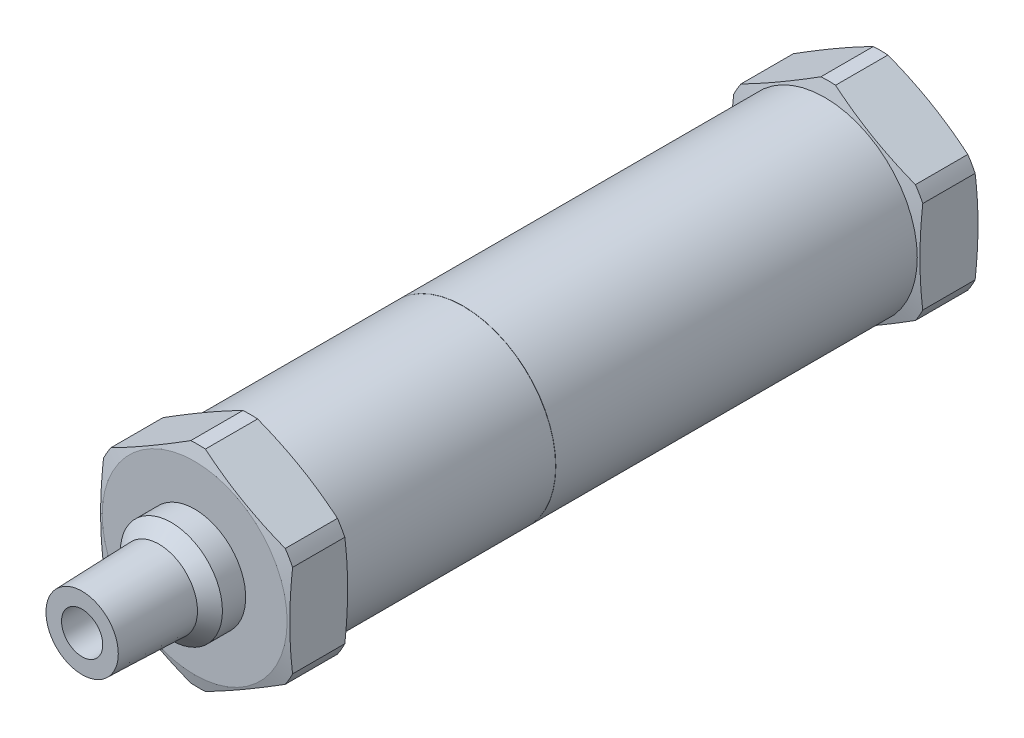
ISO-10303-21;
HEADER;
FILE_DESCRIPTION(('STEP AP214'),'2;1');
FILE_NAME('part.step','',(''),(''),'','','');
FILE_SCHEMA(('AUTOMOTIVE_DESIGN { 1 0 10303 214 1 1 1 1 }'));
ENDSEC;
DATA;
#1=APPLICATION_CONTEXT('core data for automotive mechanical design processes');
#2=APPLICATION_PROTOCOL_DEFINITION('international standard','automotive_design',2000,#1);
#3=PRODUCT_CONTEXT('',#1,'mechanical');
#4=PRODUCT('Part','Part','',(#3));
#5=PRODUCT_RELATED_PRODUCT_CATEGORY('part','',(#4));
#6=PRODUCT_DEFINITION_FORMATION('','',#4);
#7=PRODUCT_DEFINITION_CONTEXT('part definition',#1,'design');
#8=PRODUCT_DEFINITION('design','',#6,#7);
#9=PRODUCT_DEFINITION_SHAPE('','',#8);
#10=(LENGTH_UNIT() NAMED_UNIT(*) SI_UNIT(.MILLI.,.METRE.));
#11=(NAMED_UNIT(*) PLANE_ANGLE_UNIT() SI_UNIT($,.RADIAN.));
#12=(NAMED_UNIT(*) SI_UNIT($,.STERADIAN.) SOLID_ANGLE_UNIT());
#13=UNCERTAINTY_MEASURE_WITH_UNIT(LENGTH_MEASURE(1.E-05),#10,'distance_accuracy_value','');
#14=(GEOMETRIC_REPRESENTATION_CONTEXT(3) GLOBAL_UNCERTAINTY_ASSIGNED_CONTEXT((#13)) GLOBAL_UNIT_ASSIGNED_CONTEXT((#10,
#11,#12)) REPRESENTATION_CONTEXT('',''));
#15=CARTESIAN_POINT('',(0.,0.,0.));
#16=DIRECTION('',(0.,0.,1.));
#17=DIRECTION('',(1.,0.,0.));
#18=AXIS2_PLACEMENT_3D('',#15,#16,#17);
#19=CARTESIAN_POINT('',(0.,12.4206,92.583));
#20=DIRECTION('',(0.,0.,-1.));
#21=DIRECTION('',(0.,1.,0.));
#22=AXIS2_PLACEMENT_3D('',#19,#20,#21);
#23=PLANE('',#22);
#24=CARTESIAN_POINT('',(0.,0.,92.583));
#25=DIRECTION('',(0.,0.,-1.));
#26=DIRECTION('',(-1.,0.,0.));
#27=AXIS2_PLACEMENT_3D('',#24,#25,#26);
#28=CIRCLE('',#27,12.4206);
#29=CARTESIAN_POINT('',(-12.4206,0.,92.583));
#30=VERTEX_POINT('',#29);
#31=EDGE_CURVE('E307',#30,#30,#28,.T.);
#32=ORIENTED_EDGE('',*,*,#31,.F.);
#33=EDGE_LOOP('',(#32));
#34=FACE_BOUND('',#33,.T.);
#35=CARTESIAN_POINT('',(0.,0.,92.583));
#36=DIRECTION('',(0.,0.,-1.));
#37=DIRECTION('',(0.,1.,0.));
#38=AXIS2_PLACEMENT_3D('',#35,#36,#37);
#39=CIRCLE('',#38,6.858);
#40=CARTESIAN_POINT('',(-6.858,0.,92.583));
#41=VERTEX_POINT('',#40);
#42=EDGE_CURVE('E12',#41,#41,#39,.F.);
#43=ORIENTED_EDGE('',*,*,#42,.F.);
#44=EDGE_LOOP('',(#43));
#45=FACE_BOUND('',#44,.T.);
#46=ADVANCED_FACE('F39',(#34,#45),#23,.F.);
#47=CARTESIAN_POINT('',(0.,0.,0.));
#48=DIRECTION('',(0.,0.,-1.));
#49=DIRECTION('',(0.,1.,0.));
#50=AXIS2_PLACEMENT_3D('',#47,#48,#49);
#51=CYLINDRICAL_SURFACE('',#50,14.1302058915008);
#52=DIRECTION('',(0.,0.,1.));
#53=VECTOR('',#52,1.);
#54=CARTESIAN_POINT('',(0.985343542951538,14.0958084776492,107.696));
#55=LINE('',#54,#53);
#56=CARTESIAN_POINT('',(0.985343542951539,14.0958084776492,92.1249124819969));
#57=VERTEX_POINT('',#56);
#58=CARTESIAN_POINT('',(0.985343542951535,14.0958084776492,85.1162875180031));
#59=VERTEX_POINT('',#58);
#60=EDGE_CURVE('E1211',#57,#59,#55,.F.);
#61=ORIENTED_EDGE('',*,*,#60,.T.);
#62=CARTESIAN_POINT('',(0.,0.,85.1162875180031));
#63=DIRECTION('',(0.,0.,-1.));
#64=DIRECTION('',(0.,1.,0.));
#65=AXIS2_PLACEMENT_3D('',#62,#63,#64);
#66=CIRCLE('',#65,14.1302058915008);
#67=CARTESIAN_POINT('',(-0.98534354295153,14.0958084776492,85.1162875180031));
#68=VERTEX_POINT('',#67);
#69=EDGE_CURVE('E1151',#59,#68,#66,.F.);
#70=ORIENTED_EDGE('',*,*,#69,.T.);
#71=DIRECTION('',(0.,0.,1.));
#72=VECTOR('',#71,1.);
#73=CARTESIAN_POINT('',(-0.985343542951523,14.0958084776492,107.696));
#74=LINE('',#73,#72);
#75=CARTESIAN_POINT('',(-0.98534354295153,14.0958084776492,92.1249124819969));
#76=VERTEX_POINT('',#75);
#77=EDGE_CURVE('E1172',#68,#76,#74,.T.);
#78=ORIENTED_EDGE('',*,*,#77,.T.);
#79=CARTESIAN_POINT('',(0.,0.,92.1249124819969));
#80=DIRECTION('',(0.,0.,-1.));
#81=DIRECTION('',(0.,1.,0.));
#82=AXIS2_PLACEMENT_3D('',#79,#80,#81);
#83=CIRCLE('',#82,14.1302058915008);
#84=EDGE_CURVE('E217',#57,#76,#83,.F.);
#85=ORIENTED_EDGE('',*,*,#84,.F.);
#86=EDGE_LOOP('',(#61,#70,#78,#85));
#87=FACE_BOUND('',#86,.T.);
#88=ADVANCED_FACE('F283',(#87),#51,.T.);
#89=CARTESIAN_POINT('',(0.,0.,92.1249124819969));
#90=DIRECTION('',(0.,0.,-1.));
#91=DIRECTION('',(-1.,0.,0.));
#92=AXIS2_PLACEMENT_3D('',#89,#90,#91);
#93=CONICAL_SURFACE('',#92,14.1302058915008,1.30899693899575);
#94=CARTESIAN_POINT('',(0.,0.,92.1249124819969));
#95=DIRECTION('',(0.,0.,-1.));
#96=DIRECTION('',(0.,1.,0.));
#97=AXIS2_PLACEMENT_3D('',#94,#95,#96);
#98=CIRCLE('',#97,14.1302058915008);
#99=CARTESIAN_POINT('',(0.985343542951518,-14.0958084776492,92.1249124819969));
#100=VERTEX_POINT('',#99);
#101=CARTESIAN_POINT('',(-0.985343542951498,-14.0958084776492,92.1249124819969));
#102=VERTEX_POINT('',#101);
#103=EDGE_CURVE('E200',#100,#102,#98,.T.);
#104=ORIENTED_EDGE('',*,*,#103,.F.);
#105=CARTESIAN_POINT('',(0.985343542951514,-14.0958084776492,92.1249124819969));
#106=CARTESIAN_POINT('',(1.43121238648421,-13.8383859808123,92.1854295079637));
#107=CARTESIAN_POINT('',(1.87774214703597,-13.5805819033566,92.239874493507));
#108=CARTESIAN_POINT('',(2.77199821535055,-13.0642829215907,92.3349410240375));
#109=CARTESIAN_POINT('',(3.21972476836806,-12.8057878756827,92.3755594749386));
#110=CARTESIAN_POINT('',(4.11433385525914,-12.2892850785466,92.4411392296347));
#111=CARTESIAN_POINT('',(4.56121305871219,-12.0312792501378,92.4661598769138));
#112=CARTESIAN_POINT('',(5.45539487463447,-11.5150231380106,92.4996568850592));
#113=CARTESIAN_POINT('',(5.90269743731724,-11.2567728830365,92.5081349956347));
#114=CARTESIAN_POINT('',(6.79730256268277,-10.7402723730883,92.5081349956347));
#115=CARTESIAN_POINT('',(7.24460512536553,-10.4820221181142,92.4996568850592));
#116=CARTESIAN_POINT('',(8.13878694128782,-9.96576600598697,92.4661598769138));
#117=CARTESIAN_POINT('',(8.58566614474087,-9.7077601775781,92.4411392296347));
#118=CARTESIAN_POINT('',(9.48027523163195,-9.19125738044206,92.3755594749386));
#119=CARTESIAN_POINT('',(9.92800178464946,-8.93276233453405,92.3349410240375));
#120=CARTESIAN_POINT('',(10.822257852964,-8.41646335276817,92.239874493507));
#121=CARTESIAN_POINT('',(11.2687876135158,-8.15865927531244,92.1854295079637));
#122=CARTESIAN_POINT('',(11.7146564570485,-7.90123677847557,92.1249124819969));
#123=B_SPLINE_CURVE_WITH_KNOTS('',3,(#105,#106,#107,#108,#109,#110,#111,#112,#113,#114,#115,
#116,#117,#118,#119,#120,#121,#122),.UNSPECIFIED.,.F.,.F.,(4,2,2,2,2,2,2,2,4),(0.,
1.55520628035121,3.11076035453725,4.66035945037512,6.20979463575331,7.75922982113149,
9.30882891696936,10.8643829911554,12.4195892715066),.UNSPECIFIED.);
#124=CARTESIAN_POINT('',(11.7146564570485,-7.90123677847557,92.1249124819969));
#125=VERTEX_POINT('',#124);
#126=EDGE_CURVE('E235',#100,#125,#123,.T.);
#127=ORIENTED_EDGE('',*,*,#126,.T.);
#128=CARTESIAN_POINT('',(0.,0.,92.1249124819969));
#129=DIRECTION('',(0.,0.,-1.));
#130=DIRECTION('',(0.,1.,0.));
#131=AXIS2_PLACEMENT_3D('',#128,#129,#130);
#132=CIRCLE('',#131,14.1302058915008);
#133=CARTESIAN_POINT('',(12.7,-6.19457169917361,92.1249124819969));
#134=VERTEX_POINT('',#133);
#135=EDGE_CURVE('E230',#134,#125,#132,.T.);
#136=ORIENTED_EDGE('',*,*,#135,.F.);
#137=CARTESIAN_POINT('',(12.7,-6.19457169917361,92.1249124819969));
#138=CARTESIAN_POINT('',(12.7,-5.67972670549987,92.1854295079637));
#139=CARTESIAN_POINT('',(12.7,-5.1641185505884,92.239874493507));
#140=CARTESIAN_POINT('',(12.7,-4.13152058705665,92.3349410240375));
#141=CARTESIAN_POINT('',(12.7,-3.61453049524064,92.3755594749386));
#142=CARTESIAN_POINT('',(12.7,-2.58152490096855,92.4411392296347));
#143=CARTESIAN_POINT('',(12.7,-2.06551324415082,92.4661598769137));
#144=CARTESIAN_POINT('',(12.7,-1.03300101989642,92.4996568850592));
#145=CARTESIAN_POINT('',(12.7,-0.516500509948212,92.5081349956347));
#146=CARTESIAN_POINT('',(12.7,0.5165005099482,92.5081349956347));
#147=CARTESIAN_POINT('',(12.7,1.03300101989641,92.4996568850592));
#148=CARTESIAN_POINT('',(12.7,2.0655132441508,92.4661598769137));
#149=CARTESIAN_POINT('',(12.7,2.58152490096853,92.4411392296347));
#150=CARTESIAN_POINT('',(12.7,3.61453049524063,92.3755594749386));
#151=CARTESIAN_POINT('',(12.7,4.13152058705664,92.3349410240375));
#152=CARTESIAN_POINT('',(12.7,5.16411855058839,92.239874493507));
#153=CARTESIAN_POINT('',(12.7,5.67972670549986,92.1854295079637));
#154=CARTESIAN_POINT('',(12.7,6.1945716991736,92.1249124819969));
#155=B_SPLINE_CURVE_WITH_KNOTS('',3,(#137,#138,#139,#140,#141,#142,#143,#144,#145,#146,#147,
#148,#149,#150,#151,#152,#153,#154),.UNSPECIFIED.,.F.,.F.,(4,2,2,2,2,2,2,2,4),(0.,
1.55520628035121,3.11076035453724,4.66035945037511,6.20979463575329,7.75922982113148,
9.30882891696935,10.8643829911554,12.4195892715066),.UNSPECIFIED.);
#156=CARTESIAN_POINT('',(12.7,6.1945716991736,92.1249124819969));
#157=VERTEX_POINT('',#156);
#158=EDGE_CURVE('E252',#134,#157,#155,.T.);
#159=ORIENTED_EDGE('',*,*,#158,.T.);
#160=CARTESIAN_POINT('',(0.,0.,92.1249124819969));
#161=DIRECTION('',(0.,0.,-1.));
#162=DIRECTION('',(0.,1.,0.));
#163=AXIS2_PLACEMENT_3D('',#160,#161,#162);
#164=CIRCLE('',#163,14.1302058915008);
#165=CARTESIAN_POINT('',(11.7146564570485,7.90123677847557,92.1249124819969));
#166=VERTEX_POINT('',#165);
#167=EDGE_CURVE('E237',#166,#157,#164,.T.);
#168=ORIENTED_EDGE('',*,*,#167,.F.);
#169=CARTESIAN_POINT('',(11.7146564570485,7.90123677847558,92.1249124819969));
#170=CARTESIAN_POINT('',(11.2687876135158,8.15865927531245,92.1854295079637));
#171=CARTESIAN_POINT('',(10.822257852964,8.41646335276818,92.239874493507));
#172=CARTESIAN_POINT('',(9.92800178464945,8.93276233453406,92.3349410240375));
#173=CARTESIAN_POINT('',(9.48027523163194,9.19125738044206,92.3755594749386));
#174=CARTESIAN_POINT('',(8.58566614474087,9.7077601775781,92.4411392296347));
#175=CARTESIAN_POINT('',(8.13878694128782,9.96576600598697,92.4661598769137));
#176=CARTESIAN_POINT('',(7.24460512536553,10.4820221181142,92.4996568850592));
#177=CARTESIAN_POINT('',(6.79730256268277,10.7402723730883,92.5081349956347));
#178=CARTESIAN_POINT('',(5.90269743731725,11.2567728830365,92.5081349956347));
#179=CARTESIAN_POINT('',(5.45539487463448,11.5150231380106,92.4996568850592));
#180=CARTESIAN_POINT('',(4.5612130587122,12.0312792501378,92.4661598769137));
#181=CARTESIAN_POINT('',(4.11433385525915,12.2892850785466,92.4411392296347));
#182=CARTESIAN_POINT('',(3.21972476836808,12.8057878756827,92.3755594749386));
#183=CARTESIAN_POINT('',(2.77199821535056,13.0642829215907,92.3349410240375));
#184=CARTESIAN_POINT('',(1.87774214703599,13.5805819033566,92.239874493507));
#185=CARTESIAN_POINT('',(1.43121238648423,13.8383859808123,92.1854295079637));
#186=CARTESIAN_POINT('',(0.985343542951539,14.0958084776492,92.1249124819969));
#187=B_SPLINE_CURVE_WITH_KNOTS('',3,(#169,#170,#171,#172,#173,#174,#175,#176,#177,#178,#179,
#180,#181,#182,#183,#184,#185,#186),.UNSPECIFIED.,.F.,.F.,(4,2,2,2,2,2,2,2,4),(0.,
1.5552062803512,3.11076035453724,4.6603594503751,6.20979463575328,7.75922982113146,
9.30882891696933,10.8643829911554,12.4195892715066),.UNSPECIFIED.);
#188=EDGE_CURVE('E269',#166,#57,#187,.T.);
#189=ORIENTED_EDGE('',*,*,#188,.T.);
#190=ORIENTED_EDGE('',*,*,#84,.T.);
#191=CARTESIAN_POINT('',(-0.985343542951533,14.0958084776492,92.1249124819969));
#192=CARTESIAN_POINT('',(-1.43121238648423,13.8383859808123,92.1854295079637));
#193=CARTESIAN_POINT('',(-1.87774214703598,13.5805819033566,92.239874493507));
#194=CARTESIAN_POINT('',(-2.77199821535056,13.0642829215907,92.3349410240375));
#195=CARTESIAN_POINT('',(-3.21972476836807,12.8057878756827,92.3755594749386));
#196=CARTESIAN_POINT('',(-4.11433385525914,12.2892850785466,92.4411392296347));
#197=CARTESIAN_POINT('',(-4.56121305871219,12.0312792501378,92.4661598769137));
#198=CARTESIAN_POINT('',(-5.45539487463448,11.5150231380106,92.4996568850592));
#199=CARTESIAN_POINT('',(-5.90269743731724,11.2567728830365,92.5081349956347));
#200=CARTESIAN_POINT('',(-6.79730256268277,10.7402723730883,92.5081349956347));
#201=CARTESIAN_POINT('',(-7.24460512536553,10.4820221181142,92.4996568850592));
#202=CARTESIAN_POINT('',(-8.13878694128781,9.96576600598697,92.4661598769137));
#203=CARTESIAN_POINT('',(-8.58566614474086,9.7077601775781,92.4411392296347));
#204=CARTESIAN_POINT('',(-9.48027523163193,9.19125738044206,92.3755594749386));
#205=CARTESIAN_POINT('',(-9.92800178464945,8.93276233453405,92.3349410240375));
#206=CARTESIAN_POINT('',(-10.822257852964,8.41646335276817,92.239874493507));
#207=CARTESIAN_POINT('',(-11.2687876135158,8.15865927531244,92.1854295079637));
#208=CARTESIAN_POINT('',(-11.7146564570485,7.90123677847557,92.1249124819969));
#209=B_SPLINE_CURVE_WITH_KNOTS('',3,(#191,#192,#193,#194,#195,#196,#197,#198,#199,#200,#201,
#202,#203,#204,#205,#206,#207,#208),.UNSPECIFIED.,.F.,.F.,(4,2,2,2,2,2,2,2,4),(0.,
1.5552062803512,3.11076035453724,4.6603594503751,6.20979463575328,7.75922982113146,
9.30882891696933,10.8643829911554,12.4195892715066),.UNSPECIFIED.);
#210=CARTESIAN_POINT('',(-11.7146564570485,7.90123677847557,92.1249124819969));
#211=VERTEX_POINT('',#210);
#212=EDGE_CURVE('E289',#76,#211,#209,.T.);
#213=ORIENTED_EDGE('',*,*,#212,.T.);
#214=CARTESIAN_POINT('',(0.,0.,92.1249124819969));
#215=DIRECTION('',(0.,0.,-1.));
#216=DIRECTION('',(0.,1.,0.));
#217=AXIS2_PLACEMENT_3D('',#214,#215,#216);
#218=CIRCLE('',#217,14.1302058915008);
#219=CARTESIAN_POINT('',(-12.7,6.19457169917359,92.1249124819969));
#220=VERTEX_POINT('',#219);
#221=EDGE_CURVE('E472',#220,#211,#218,.T.);
#222=ORIENTED_EDGE('',*,*,#221,.F.);
#223=CARTESIAN_POINT('',(-12.7,6.19457169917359,92.1249124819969));
#224=CARTESIAN_POINT('',(-12.7,5.67972670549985,92.1854295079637));
#225=CARTESIAN_POINT('',(-12.7,5.16411855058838,92.239874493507));
#226=CARTESIAN_POINT('',(-12.7,4.13152058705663,92.3349410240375));
#227=CARTESIAN_POINT('',(-12.7,3.61453049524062,92.3755594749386));
#228=CARTESIAN_POINT('',(-12.7,2.58152490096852,92.4411392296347));
#229=CARTESIAN_POINT('',(-12.7,2.06551324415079,92.4661598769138));
#230=CARTESIAN_POINT('',(-12.7,1.03300101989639,92.4996568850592));
#231=CARTESIAN_POINT('',(-12.7,0.516500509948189,92.5081349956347));
#232=CARTESIAN_POINT('',(-12.7,-0.516500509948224,92.5081349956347));
#233=CARTESIAN_POINT('',(-12.7,-1.03300101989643,92.4996568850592));
#234=CARTESIAN_POINT('',(-12.7,-2.06551324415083,92.4661598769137));
#235=CARTESIAN_POINT('',(-12.7,-2.58152490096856,92.4411392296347));
#236=CARTESIAN_POINT('',(-12.7,-3.61453049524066,92.3755594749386));
#237=CARTESIAN_POINT('',(-12.7,-4.13152058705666,92.3349410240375));
#238=CARTESIAN_POINT('',(-12.7,-5.16411855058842,92.239874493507));
#239=CARTESIAN_POINT('',(-12.7,-5.67972670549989,92.1854295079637));
#240=CARTESIAN_POINT('',(-12.7,-6.19457169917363,92.1249124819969));
#241=B_SPLINE_CURVE_WITH_KNOTS('',3,(#223,#224,#225,#226,#227,#228,#229,#230,#231,#232,#233,
#234,#235,#236,#237,#238,#239,#240),.UNSPECIFIED.,.F.,.F.,(4,2,2,2,2,2,2,2,4),(0.,
1.55520628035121,3.11076035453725,4.66035945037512,6.2097946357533,7.75922982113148,
9.30882891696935,10.8643829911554,12.4195892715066),.UNSPECIFIED.);
#242=CARTESIAN_POINT('',(-12.7,-6.19457169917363,92.1249124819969));
#243=VERTEX_POINT('',#242);
#244=EDGE_CURVE('E297',#220,#243,#241,.T.);
#245=ORIENTED_EDGE('',*,*,#244,.T.);
#246=CARTESIAN_POINT('',(0.,0.,92.1249124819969));
#247=DIRECTION('',(0.,0.,-1.));
#248=DIRECTION('',(0.,1.,0.));
#249=AXIS2_PLACEMENT_3D('',#246,#247,#248);
#250=CIRCLE('',#249,14.1302058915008);
#251=CARTESIAN_POINT('',(-11.7146564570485,-7.90123677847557,92.1249124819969));
#252=VERTEX_POINT('',#251);
#253=EDGE_CURVE('E203',#252,#243,#250,.T.);
#254=ORIENTED_EDGE('',*,*,#253,.F.);
#255=CARTESIAN_POINT('',(-11.7146564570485,-7.90123677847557,92.1249124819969));
#256=CARTESIAN_POINT('',(-11.2687876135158,-8.15865927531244,92.1854295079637));
#257=CARTESIAN_POINT('',(-10.822257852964,-8.41646335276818,92.239874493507));
#258=CARTESIAN_POINT('',(-9.92800178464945,-8.93276233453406,92.3349410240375));
#259=CARTESIAN_POINT('',(-9.48027523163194,-9.19125738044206,92.3755594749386));
#260=CARTESIAN_POINT('',(-8.58566614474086,-9.70776017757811,92.4411392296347));
#261=CARTESIAN_POINT('',(-8.13878694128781,-9.96576600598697,92.4661598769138));
#262=CARTESIAN_POINT('',(-7.24460512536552,-10.4820221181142,92.4996568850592));
#263=CARTESIAN_POINT('',(-6.79730256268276,-10.7402723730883,92.5081349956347));
#264=CARTESIAN_POINT('',(-5.90269743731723,-11.2567728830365,92.5081349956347));
#265=CARTESIAN_POINT('',(-5.45539487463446,-11.5150231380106,92.4996568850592));
#266=CARTESIAN_POINT('',(-4.56121305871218,-12.0312792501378,92.4661598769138));
#267=CARTESIAN_POINT('',(-4.11433385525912,-12.2892850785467,92.4411392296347));
#268=CARTESIAN_POINT('',(-3.21972476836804,-12.8057878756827,92.3755594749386));
#269=CARTESIAN_POINT('',(-2.77199821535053,-13.0642829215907,92.3349410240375));
#270=CARTESIAN_POINT('',(-1.87774214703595,-13.5805819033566,92.239874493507));
#271=CARTESIAN_POINT('',(-1.4312123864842,-13.8383859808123,92.1854295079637));
#272=CARTESIAN_POINT('',(-0.985343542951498,-14.0958084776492,92.1249124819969));
#273=B_SPLINE_CURVE_WITH_KNOTS('',3,(#255,#256,#257,#258,#259,#260,#261,#262,#263,#264,#265,
#266,#267,#268,#269,#270,#271,#272),.UNSPECIFIED.,.F.,.F.,(4,2,2,2,2,2,2,2,4),(0.,
1.55520628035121,3.11076035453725,4.66035945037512,6.20979463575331,7.7592298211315,
9.30882891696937,10.8643829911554,12.4195892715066),.UNSPECIFIED.);
#274=EDGE_CURVE('E194',#252,#102,#273,.T.);
#275=ORIENTED_EDGE('',*,*,#274,.T.);
#276=EDGE_LOOP('',(#104,#127,#136,#159,#168,#189,#190,#213,#222,#245,#254,#275));
#277=FACE_BOUND('',#276,.T.);
#278=ORIENTED_EDGE('',*,*,#31,.T.);
#279=EDGE_LOOP('',(#278));
#280=FACE_BOUND('',#279,.T.);
#281=ADVANCED_FACE('F198',(#277,#280),#93,.T.);
#282=CARTESIAN_POINT('',(0.,0.,0.));
#283=DIRECTION('',(0.,0.,-1.));
#284=DIRECTION('',(0.,1.,0.));
#285=AXIS2_PLACEMENT_3D('',#282,#283,#284);
#286=CYLINDRICAL_SURFACE('',#285,14.1302058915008);
#287=DIRECTION('',(0.,0.,1.));
#288=VECTOR('',#287,1.);
#289=CARTESIAN_POINT('',(-0.985343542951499,-14.0958084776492,107.696));
#290=LINE('',#289,#288);
#291=CARTESIAN_POINT('',(-0.985343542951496,-14.0958084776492,85.1162875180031));
#292=VERTEX_POINT('',#291);
#293=EDGE_CURVE('E206',#102,#292,#290,.F.);
#294=ORIENTED_EDGE('',*,*,#293,.T.);
#295=CARTESIAN_POINT('',(0.,0.,85.1162875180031));
#296=DIRECTION('',(0.,0.,-1.));
#297=DIRECTION('',(0.,1.,0.));
#298=AXIS2_PLACEMENT_3D('',#295,#296,#297);
#299=CIRCLE('',#298,14.1302058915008);
#300=CARTESIAN_POINT('',(0.98534354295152,-14.0958084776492,85.1162875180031));
#301=VERTEX_POINT('',#300);
#302=EDGE_CURVE('E207',#292,#301,#299,.F.);
#303=ORIENTED_EDGE('',*,*,#302,.T.);
#304=DIRECTION('',(0.,0.,1.));
#305=VECTOR('',#304,1.);
#306=CARTESIAN_POINT('',(0.985343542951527,-14.0958084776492,107.696));
#307=LINE('',#306,#305);
#308=EDGE_CURVE('E214',#301,#100,#307,.T.);
#309=ORIENTED_EDGE('',*,*,#308,.T.);
#310=ORIENTED_EDGE('',*,*,#103,.T.);
#311=EDGE_LOOP('',(#294,#303,#309,#310));
#312=FACE_BOUND('',#311,.T.);
#313=ADVANCED_FACE('F211',(#312),#286,.T.);
#314=CARTESIAN_POINT('',(-12.7,-7.33234841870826,107.696));
#315=DIRECTION('',(0.5,0.866025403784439,0.));
#316=DIRECTION('',(-0.866025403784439,0.5,0.));
#317=AXIS2_PLACEMENT_3D('',#314,#315,#316);
#318=PLANE('',#317);
#319=CARTESIAN_POINT('',(-0.985343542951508,-14.0958084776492,85.1162875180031));
#320=CARTESIAN_POINT('',(-1.43121238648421,-13.8383859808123,85.0557704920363));
#321=CARTESIAN_POINT('',(-1.87774214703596,-13.5805819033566,85.001325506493));
#322=CARTESIAN_POINT('',(-2.77199821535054,-13.0642829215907,84.9062589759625));
#323=CARTESIAN_POINT('',(-3.21972476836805,-12.8057878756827,84.8656405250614));
#324=CARTESIAN_POINT('',(-4.11433385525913,-12.2892850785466,84.8000607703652));
#325=CARTESIAN_POINT('',(-4.56121305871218,-12.0312792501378,84.7750401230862));
#326=CARTESIAN_POINT('',(-5.45539487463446,-11.5150231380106,84.7415431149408));
#327=CARTESIAN_POINT('',(-5.90269743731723,-11.2567728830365,84.7330650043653));
#328=CARTESIAN_POINT('',(-6.79730256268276,-10.7402723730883,84.7330650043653));
#329=CARTESIAN_POINT('',(-7.24460512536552,-10.4820221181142,84.7415431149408));
#330=CARTESIAN_POINT('',(-8.1387869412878,-9.96576600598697,84.7750401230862));
#331=CARTESIAN_POINT('',(-8.58566614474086,-9.70776017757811,84.8000607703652));
#332=CARTESIAN_POINT('',(-9.48027523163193,-9.19125738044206,84.8656405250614));
#333=CARTESIAN_POINT('',(-9.92800178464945,-8.93276233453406,84.9062589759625));
#334=CARTESIAN_POINT('',(-10.822257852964,-8.41646335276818,85.001325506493));
#335=CARTESIAN_POINT('',(-11.2687876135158,-8.15865927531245,85.0557704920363));
#336=CARTESIAN_POINT('',(-11.7146564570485,-7.90123677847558,85.1162875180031));
#337=B_SPLINE_CURVE_WITH_KNOTS('',3,(#319,#320,#321,#322,#323,#324,#325,#326,#327,#328,#329,
#330,#331,#332,#333,#334,#335,#336),.UNSPECIFIED.,.F.,.F.,(4,2,2,2,2,2,2,2,4),(0.,
1.5552062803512,3.11076035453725,4.66035945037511,6.2097946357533,7.75922982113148,
9.30882891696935,10.8643829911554,12.4195892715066),.UNSPECIFIED.);
#338=CARTESIAN_POINT('',(-11.7146564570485,-7.90123677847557,85.1162875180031));
#339=VERTEX_POINT('',#338);
#340=EDGE_CURVE('E221',#292,#339,#337,.T.);
#341=ORIENTED_EDGE('',*,*,#340,.F.);
#342=ORIENTED_EDGE('',*,*,#293,.F.);
#343=ORIENTED_EDGE('',*,*,#274,.F.);
#344=DIRECTION('',(0.,0.,-1.));
#345=VECTOR('',#344,1.);
#346=CARTESIAN_POINT('',(-11.7146564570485,-7.90123677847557,0.));
#347=LINE('',#346,#345);
#348=EDGE_CURVE('E223',#339,#252,#347,.F.);
#349=ORIENTED_EDGE('',*,*,#348,.F.);
#350=EDGE_LOOP('',(#341,#342,#343,#349));
#351=FACE_BOUND('',#350,.T.);
#352=ADVANCED_FACE('F219',(#351),#318,.F.);
#353=CARTESIAN_POINT('',(0.,0.,0.));
#354=DIRECTION('',(0.,0.,-1.));
#355=DIRECTION('',(0.,1.,0.));
#356=AXIS2_PLACEMENT_3D('',#353,#354,#355);
#357=CYLINDRICAL_SURFACE('',#356,14.1302058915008);
#358=ORIENTED_EDGE('',*,*,#253,.T.);
#359=DIRECTION('',(0.,0.,1.));
#360=VECTOR('',#359,1.);
#361=CARTESIAN_POINT('',(-12.7,-6.19457169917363,107.696));
#362=LINE('',#361,#360);
#363=CARTESIAN_POINT('',(-12.7,-6.19457169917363,85.1162875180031));
#364=VERTEX_POINT('',#363);
#365=EDGE_CURVE('E1188',#243,#364,#362,.F.);
#366=ORIENTED_EDGE('',*,*,#365,.T.);
#367=CARTESIAN_POINT('',(0.,0.,85.1162875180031));
#368=DIRECTION('',(0.,0.,1.));
#369=DIRECTION('',(0.,-1.,0.));
#370=AXIS2_PLACEMENT_3D('',#367,#368,#369);
#371=CIRCLE('',#370,14.1302058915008);
#372=EDGE_CURVE('E322',#339,#364,#371,.F.);
#373=ORIENTED_EDGE('',*,*,#372,.F.);
#374=ORIENTED_EDGE('',*,*,#348,.T.);
#375=EDGE_LOOP('',(#358,#366,#373,#374));
#376=FACE_BOUND('',#375,.T.);
#377=ADVANCED_FACE('F313',(#376),#357,.T.);
#378=CARTESIAN_POINT('',(-12.7,7.33234841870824,107.696));
#379=DIRECTION('',(1.,0.,0.));
#380=DIRECTION('',(0.,1.,0.));
#381=AXIS2_PLACEMENT_3D('',#378,#379,#380);
#382=PLANE('',#381);
#383=CARTESIAN_POINT('',(-12.7,-6.19457169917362,85.1162875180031));
#384=CARTESIAN_POINT('',(-12.7,-5.67972670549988,85.0557704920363));
#385=CARTESIAN_POINT('',(-12.7,-5.16411855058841,85.001325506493));
#386=CARTESIAN_POINT('',(-12.7,-4.13152058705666,84.9062589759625));
#387=CARTESIAN_POINT('',(-12.7,-3.61453049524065,84.8656405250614));
#388=CARTESIAN_POINT('',(-12.7,-2.58152490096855,84.8000607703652));
#389=CARTESIAN_POINT('',(-12.7,-2.06551324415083,84.7750401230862));
#390=CARTESIAN_POINT('',(-12.7,-1.03300101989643,84.7415431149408));
#391=CARTESIAN_POINT('',(-12.7,-0.51650050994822,84.7330650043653));
#392=CARTESIAN_POINT('',(-12.7,0.516500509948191,84.7330650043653));
#393=CARTESIAN_POINT('',(-12.7,1.0330010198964,84.7415431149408));
#394=CARTESIAN_POINT('',(-12.7,2.0655132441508,84.7750401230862));
#395=CARTESIAN_POINT('',(-12.7,2.58152490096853,84.8000607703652));
#396=CARTESIAN_POINT('',(-12.7,3.61453049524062,84.8656405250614));
#397=CARTESIAN_POINT('',(-12.7,4.13152058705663,84.9062589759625));
#398=CARTESIAN_POINT('',(-12.7,5.16411855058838,85.001325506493));
#399=CARTESIAN_POINT('',(-12.7,5.67972670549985,85.0557704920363));
#400=CARTESIAN_POINT('',(-12.7,6.19457169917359,85.1162875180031));
#401=B_SPLINE_CURVE_WITH_KNOTS('',3,(#383,#384,#385,#386,#387,#388,#389,#390,#391,#392,#393,
#394,#395,#396,#397,#398,#399,#400),.UNSPECIFIED.,.F.,.F.,(4,2,2,2,2,2,2,2,4),(0.,
1.5552062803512,3.11076035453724,4.66035945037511,6.20979463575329,7.75922982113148,
9.30882891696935,10.8643829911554,12.4195892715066),.UNSPECIFIED.);
#402=CARTESIAN_POINT('',(-12.7,6.19457169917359,85.1162875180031));
#403=VERTEX_POINT('',#402);
#404=EDGE_CURVE('E323',#364,#403,#401,.T.);
#405=ORIENTED_EDGE('',*,*,#404,.F.);
#406=ORIENTED_EDGE('',*,*,#365,.F.);
#407=ORIENTED_EDGE('',*,*,#244,.F.);
#408=DIRECTION('',(0.,0.,-1.));
#409=VECTOR('',#408,1.);
#410=CARTESIAN_POINT('',(-12.7,6.19457169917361,0.));
#411=LINE('',#410,#409);
#412=EDGE_CURVE('E1184',#403,#220,#411,.F.);
#413=ORIENTED_EDGE('',*,*,#412,.F.);
#414=EDGE_LOOP('',(#405,#406,#407,#413));
#415=FACE_BOUND('',#414,.T.);
#416=ADVANCED_FACE('F504',(#415),#382,.F.);
#417=CARTESIAN_POINT('',(0.,0.,0.));
#418=DIRECTION('',(0.,0.,-1.));
#419=DIRECTION('',(0.,1.,0.));
#420=AXIS2_PLACEMENT_3D('',#417,#418,#419);
#421=CYLINDRICAL_SURFACE('',#420,14.1302058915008);
#422=ORIENTED_EDGE('',*,*,#221,.T.);
#423=DIRECTION('',(0.,0.,1.));
#424=VECTOR('',#423,1.);
#425=CARTESIAN_POINT('',(-11.7146564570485,7.90123677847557,107.696));
#426=LINE('',#425,#424);
#427=CARTESIAN_POINT('',(-11.7146564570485,7.90123677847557,85.1162875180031));
#428=VERTEX_POINT('',#427);
#429=EDGE_CURVE('E1176',#211,#428,#426,.F.);
#430=ORIENTED_EDGE('',*,*,#429,.T.);
#431=CARTESIAN_POINT('',(0.,0.,85.1162875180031));
#432=DIRECTION('',(0.,0.,1.));
#433=DIRECTION('',(0.,-1.,0.));
#434=AXIS2_PLACEMENT_3D('',#431,#432,#433);
#435=CIRCLE('',#434,14.1302058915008);
#436=EDGE_CURVE('E1195',#403,#428,#435,.F.);
#437=ORIENTED_EDGE('',*,*,#436,.F.);
#438=ORIENTED_EDGE('',*,*,#412,.T.);
#439=EDGE_LOOP('',(#422,#430,#437,#438));
#440=FACE_BOUND('',#439,.T.);
#441=ADVANCED_FACE('F500',(#440),#421,.T.);
#442=CARTESIAN_POINT('',(0.,14.6646968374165,107.696));
#443=DIRECTION('',(0.5,-0.866025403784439,0.));
#444=DIRECTION('',(0.866025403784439,0.5,0.));
#445=AXIS2_PLACEMENT_3D('',#442,#443,#444);
#446=PLANE('',#445);
#447=CARTESIAN_POINT('',(-11.7146564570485,7.90123677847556,85.1162875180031));
#448=CARTESIAN_POINT('',(-11.2687876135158,8.15865927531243,85.0557704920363));
#449=CARTESIAN_POINT('',(-10.822257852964,8.41646335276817,85.001325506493));
#450=CARTESIAN_POINT('',(-9.92800178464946,8.93276233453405,84.9062589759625));
#451=CARTESIAN_POINT('',(-9.48027523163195,9.19125738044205,84.8656405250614));
#452=CARTESIAN_POINT('',(-8.58566614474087,9.7077601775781,84.8000607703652));
#453=CARTESIAN_POINT('',(-8.13878694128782,9.96576600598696,84.7750401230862));
#454=CARTESIAN_POINT('',(-7.24460512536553,10.4820221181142,84.7415431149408));
#455=CARTESIAN_POINT('',(-6.79730256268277,10.7402723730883,84.7330650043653));
#456=CARTESIAN_POINT('',(-5.90269743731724,11.2567728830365,84.7330650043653));
#457=CARTESIAN_POINT('',(-5.45539487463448,11.5150231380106,84.7415431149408));
#458=CARTESIAN_POINT('',(-4.56121305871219,12.0312792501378,84.7750401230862));
#459=CARTESIAN_POINT('',(-4.11433385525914,12.2892850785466,84.8000607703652));
#460=CARTESIAN_POINT('',(-3.21972476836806,12.8057878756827,84.8656405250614));
#461=CARTESIAN_POINT('',(-2.77199821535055,13.0642829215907,84.9062589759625));
#462=CARTESIAN_POINT('',(-1.87774214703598,13.5805819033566,85.001325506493));
#463=CARTESIAN_POINT('',(-1.43121238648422,13.8383859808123,85.0557704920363));
#464=CARTESIAN_POINT('',(-0.985343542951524,14.0958084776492,85.1162875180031));
#465=B_SPLINE_CURVE_WITH_KNOTS('',3,(#447,#448,#449,#450,#451,#452,#453,#454,#455,#456,#457,
#458,#459,#460,#461,#462,#463,#464),.UNSPECIFIED.,.F.,.F.,(4,2,2,2,2,2,2,2,4),(0.,
1.5552062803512,3.11076035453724,4.66035945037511,6.2097946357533,7.75922982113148,
9.30882891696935,10.8643829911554,12.4195892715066),.UNSPECIFIED.);
#466=EDGE_CURVE('E352',#428,#68,#465,.T.);
#467=ORIENTED_EDGE('',*,*,#466,.F.);
#468=ORIENTED_EDGE('',*,*,#429,.F.);
#469=ORIENTED_EDGE('',*,*,#212,.F.);
#470=ORIENTED_EDGE('',*,*,#77,.F.);
#471=EDGE_LOOP('',(#467,#468,#469,#470));
#472=FACE_BOUND('',#471,.T.);
#473=ADVANCED_FACE('F494',(#472),#446,.F.);
#474=CARTESIAN_POINT('',(12.7,7.33234841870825,107.696));
#475=DIRECTION('',(-0.5,-0.866025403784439,0.));
#476=DIRECTION('',(0.866025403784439,-0.5,0.));
#477=AXIS2_PLACEMENT_3D('',#474,#475,#476);
#478=PLANE('',#477);
#479=CARTESIAN_POINT('',(0.985343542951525,14.0958084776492,85.1162875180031));
#480=CARTESIAN_POINT('',(1.43121238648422,13.8383859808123,85.0557704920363));
#481=CARTESIAN_POINT('',(1.87774214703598,13.5805819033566,85.001325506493));
#482=CARTESIAN_POINT('',(2.77199821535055,13.0642829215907,84.9062589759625));
#483=CARTESIAN_POINT('',(3.21972476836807,12.8057878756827,84.8656405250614));
#484=CARTESIAN_POINT('',(4.11433385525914,12.2892850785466,84.8000607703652));
#485=CARTESIAN_POINT('',(4.56121305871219,12.0312792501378,84.7750401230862));
#486=CARTESIAN_POINT('',(5.45539487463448,11.5150231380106,84.7415431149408));
#487=CARTESIAN_POINT('',(5.90269743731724,11.2567728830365,84.7330650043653));
#488=CARTESIAN_POINT('',(6.79730256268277,10.7402723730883,84.7330650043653));
#489=CARTESIAN_POINT('',(7.24460512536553,10.4820221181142,84.7415431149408));
#490=CARTESIAN_POINT('',(8.13878694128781,9.96576600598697,84.7750401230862));
#491=CARTESIAN_POINT('',(8.58566614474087,9.7077601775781,84.8000607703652));
#492=CARTESIAN_POINT('',(9.48027523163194,9.19125738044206,84.8656405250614));
#493=CARTESIAN_POINT('',(9.92800178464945,8.93276233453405,84.9062589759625));
#494=CARTESIAN_POINT('',(10.822257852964,8.41646335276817,85.001325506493));
#495=CARTESIAN_POINT('',(11.2687876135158,8.15865927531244,85.0557704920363));
#496=CARTESIAN_POINT('',(11.7146564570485,7.90123677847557,85.1162875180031));
#497=B_SPLINE_CURVE_WITH_KNOTS('',3,(#479,#480,#481,#482,#483,#484,#485,#486,#487,#488,#489,
#490,#491,#492,#493,#494,#495,#496),.UNSPECIFIED.,.F.,.F.,(4,2,2,2,2,2,2,2,4),(0.,
1.5552062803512,3.11076035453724,4.66035945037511,6.20979463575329,7.75922982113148,
9.30882891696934,10.8643829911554,12.4195892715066),.UNSPECIFIED.);
#498=CARTESIAN_POINT('',(11.7146564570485,7.90123677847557,85.1162875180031));
#499=VERTEX_POINT('',#498);
#500=EDGE_CURVE('E480',#59,#499,#497,.T.);
#501=ORIENTED_EDGE('',*,*,#500,.F.);
#502=ORIENTED_EDGE('',*,*,#60,.F.);
#503=ORIENTED_EDGE('',*,*,#188,.F.);
#504=DIRECTION('',(0.,0.,-1.));
#505=VECTOR('',#504,1.);
#506=CARTESIAN_POINT('',(11.7146564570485,7.90123677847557,0.));
#507=LINE('',#506,#505);
#508=EDGE_CURVE('E262',#499,#166,#507,.F.);
#509=ORIENTED_EDGE('',*,*,#508,.F.);
#510=EDGE_LOOP('',(#501,#502,#503,#509));
#511=FACE_BOUND('',#510,.T.);
#512=ADVANCED_FACE('F490',(#511),#478,.F.);
#513=CARTESIAN_POINT('',(0.,0.,0.));
#514=DIRECTION('',(0.,0.,-1.));
#515=DIRECTION('',(0.,1.,0.));
#516=AXIS2_PLACEMENT_3D('',#513,#514,#515);
#517=CYLINDRICAL_SURFACE('',#516,14.1302058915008);
#518=CARTESIAN_POINT('',(0.,0.,85.1162875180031));
#519=DIRECTION('',(0.,0.,1.));
#520=DIRECTION('',(0.,-1.,0.));
#521=AXIS2_PLACEMENT_3D('',#518,#519,#520);
#522=CIRCLE('',#521,14.1302058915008);
#523=CARTESIAN_POINT('',(12.7,6.1945716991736,85.1162875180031));
#524=VERTEX_POINT('',#523);
#525=EDGE_CURVE('E487',#499,#524,#522,.F.);
#526=ORIENTED_EDGE('',*,*,#525,.F.);
#527=ORIENTED_EDGE('',*,*,#508,.T.);
#528=ORIENTED_EDGE('',*,*,#167,.T.);
#529=DIRECTION('',(0.,0.,1.));
#530=VECTOR('',#529,1.);
#531=CARTESIAN_POINT('',(12.7,6.1945716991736,107.696));
#532=LINE('',#531,#530);
#533=EDGE_CURVE('E261',#157,#524,#532,.F.);
#534=ORIENTED_EDGE('',*,*,#533,.T.);
#535=EDGE_LOOP('',(#526,#527,#528,#534));
#536=FACE_BOUND('',#535,.T.);
#537=ADVANCED_FACE('F493',(#536),#517,.T.);
#538=CARTESIAN_POINT('',(12.7,-7.33234841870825,107.696));
#539=DIRECTION('',(-1.,0.,0.));
#540=DIRECTION('',(0.,-1.,0.));
#541=AXIS2_PLACEMENT_3D('',#538,#539,#540);
#542=PLANE('',#541);
#543=CARTESIAN_POINT('',(12.7,6.1945716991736,85.1162875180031));
#544=CARTESIAN_POINT('',(12.7,5.67972670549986,85.0557704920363));
#545=CARTESIAN_POINT('',(12.7,5.16411855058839,85.001325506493));
#546=CARTESIAN_POINT('',(12.7,4.13152058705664,84.9062589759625));
#547=CARTESIAN_POINT('',(12.7,3.61453049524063,84.8656405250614));
#548=CARTESIAN_POINT('',(12.7,2.58152490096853,84.8000607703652));
#549=CARTESIAN_POINT('',(12.7,2.06551324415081,84.7750401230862));
#550=CARTESIAN_POINT('',(12.7,1.03300101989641,84.7415431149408));
#551=CARTESIAN_POINT('',(12.7,0.516500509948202,84.7330650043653));
#552=CARTESIAN_POINT('',(12.7,-0.51650050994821,84.7330650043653));
#553=CARTESIAN_POINT('',(12.7,-1.03300101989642,84.7415431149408));
#554=CARTESIAN_POINT('',(12.7,-2.06551324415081,84.7750401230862));
#555=CARTESIAN_POINT('',(12.7,-2.58152490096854,84.8000607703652));
#556=CARTESIAN_POINT('',(12.7,-3.61453049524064,84.8656405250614));
#557=CARTESIAN_POINT('',(12.7,-4.13152058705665,84.9062589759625));
#558=CARTESIAN_POINT('',(12.7,-5.1641185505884,85.001325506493));
#559=CARTESIAN_POINT('',(12.7,-5.67972670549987,85.0557704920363));
#560=CARTESIAN_POINT('',(12.7,-6.19457169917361,85.1162875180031));
#561=B_SPLINE_CURVE_WITH_KNOTS('',3,(#543,#544,#545,#546,#547,#548,#549,#550,#551,#552,#553,
#554,#555,#556,#557,#558,#559,#560),.UNSPECIFIED.,.F.,.F.,(4,2,2,2,2,2,2,2,4),(0.,
1.5552062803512,3.11076035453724,4.66035945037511,6.20979463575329,7.75922982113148,
9.30882891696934,10.8643829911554,12.4195892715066),.UNSPECIFIED.);
#562=CARTESIAN_POINT('',(12.7,-6.19457169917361,85.1162875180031));
#563=VERTEX_POINT('',#562);
#564=EDGE_CURVE('E343',#524,#563,#561,.T.);
#565=ORIENTED_EDGE('',*,*,#564,.F.);
#566=ORIENTED_EDGE('',*,*,#533,.F.);
#567=ORIENTED_EDGE('',*,*,#158,.F.);
#568=DIRECTION('',(0.,0.,-1.));
#569=VECTOR('',#568,1.);
#570=CARTESIAN_POINT('',(12.7,-6.1945716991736,0.));
#571=LINE('',#570,#569);
#572=EDGE_CURVE('E236',#563,#134,#571,.F.);
#573=ORIENTED_EDGE('',*,*,#572,.F.);
#574=EDGE_LOOP('',(#565,#566,#567,#573));
#575=FACE_BOUND('',#574,.T.);
#576=ADVANCED_FACE('F276',(#575),#542,.F.);
#577=CARTESIAN_POINT('',(0.,0.,0.));
#578=DIRECTION('',(0.,0.,-1.));
#579=DIRECTION('',(0.,1.,0.));
#580=AXIS2_PLACEMENT_3D('',#577,#578,#579);
#581=CYLINDRICAL_SURFACE('',#580,14.1302058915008);
#582=ORIENTED_EDGE('',*,*,#135,.T.);
#583=DIRECTION('',(0.,0.,1.));
#584=VECTOR('',#583,1.);
#585=CARTESIAN_POINT('',(11.7146564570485,-7.90123677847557,107.696));
#586=LINE('',#585,#584);
#587=CARTESIAN_POINT('',(11.7146564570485,-7.90123677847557,85.1162875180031));
#588=VERTEX_POINT('',#587);
#589=EDGE_CURVE('E1234',#125,#588,#586,.F.);
#590=ORIENTED_EDGE('',*,*,#589,.T.);
#591=CARTESIAN_POINT('',(0.,0.,85.1162875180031));
#592=DIRECTION('',(0.,0.,1.));
#593=DIRECTION('',(0.,-1.,0.));
#594=AXIS2_PLACEMENT_3D('',#591,#592,#593);
#595=CIRCLE('',#594,14.1302058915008);
#596=EDGE_CURVE('E367',#563,#588,#595,.F.);
#597=ORIENTED_EDGE('',*,*,#596,.F.);
#598=ORIENTED_EDGE('',*,*,#572,.T.);
#599=EDGE_LOOP('',(#582,#590,#597,#598));
#600=FACE_BOUND('',#599,.T.);
#601=ADVANCED_FACE('F968',(#600),#581,.T.);
#602=CARTESIAN_POINT('',(0.,-14.6646968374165,107.696));
#603=DIRECTION('',(-0.5,0.866025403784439,0.));
#604=DIRECTION('',(-0.866025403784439,-0.5,0.));
#605=AXIS2_PLACEMENT_3D('',#602,#603,#604);
#606=PLANE('',#605);
#607=CARTESIAN_POINT('',(11.7146564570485,-7.90123677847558,85.1162875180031));
#608=CARTESIAN_POINT('',(11.2687876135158,-8.15865927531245,85.0557704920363));
#609=CARTESIAN_POINT('',(10.822257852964,-8.41646335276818,85.001325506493));
#610=CARTESIAN_POINT('',(9.92800178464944,-8.93276233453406,84.9062589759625));
#611=CARTESIAN_POINT('',(9.48027523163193,-9.19125738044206,84.8656405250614));
#612=CARTESIAN_POINT('',(8.58566614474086,-9.70776017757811,84.8000607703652));
#613=CARTESIAN_POINT('',(8.13878694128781,-9.96576600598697,84.7750401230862));
#614=CARTESIAN_POINT('',(7.24460512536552,-10.4820221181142,84.7415431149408));
#615=CARTESIAN_POINT('',(6.79730256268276,-10.7402723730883,84.7330650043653));
#616=CARTESIAN_POINT('',(5.90269743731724,-11.2567728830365,84.7330650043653));
#617=CARTESIAN_POINT('',(5.45539487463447,-11.5150231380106,84.7415431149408));
#618=CARTESIAN_POINT('',(4.56121305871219,-12.0312792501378,84.7750401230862));
#619=CARTESIAN_POINT('',(4.11433385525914,-12.2892850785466,84.8000607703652));
#620=CARTESIAN_POINT('',(3.21972476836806,-12.8057878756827,84.8656405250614));
#621=CARTESIAN_POINT('',(2.77199821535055,-13.0642829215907,84.9062589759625));
#622=CARTESIAN_POINT('',(1.87774214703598,-13.5805819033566,85.001325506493));
#623=CARTESIAN_POINT('',(1.43121238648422,-13.8383859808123,85.0557704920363));
#624=CARTESIAN_POINT('',(0.985343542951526,-14.0958084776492,85.1162875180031));
#625=B_SPLINE_CURVE_WITH_KNOTS('',3,(#607,#608,#609,#610,#611,#612,#613,#614,#615,#616,#617,
#618,#619,#620,#621,#622,#623,#624),.UNSPECIFIED.,.F.,.F.,(4,2,2,2,2,2,2,2,4),(0.,
1.5552062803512,3.11076035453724,4.66035945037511,6.20979463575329,7.75922982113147,
9.30882891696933,10.8643829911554,12.4195892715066),.UNSPECIFIED.);
#626=EDGE_CURVE('E358',#588,#301,#625,.T.);
#627=ORIENTED_EDGE('',*,*,#626,.F.);
#628=ORIENTED_EDGE('',*,*,#589,.F.);
#629=ORIENTED_EDGE('',*,*,#126,.F.);
#630=ORIENTED_EDGE('',*,*,#308,.F.);
#631=EDGE_LOOP('',(#627,#628,#629,#630));
#632=FACE_BOUND('',#631,.T.);
#633=ADVANCED_FACE('F336',(#632),#606,.F.);
#634=CARTESIAN_POINT('',(0.,0.,85.1162875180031));
#635=DIRECTION('',(0.,0.,1.));
#636=DIRECTION('',(1.,0.,0.));
#637=AXIS2_PLACEMENT_3D('',#634,#635,#636);
#638=CONICAL_SURFACE('',#637,14.1302058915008,1.30899693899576);
#639=ORIENTED_EDGE('',*,*,#466,.T.);
#640=ORIENTED_EDGE('',*,*,#69,.F.);
#641=ORIENTED_EDGE('',*,*,#500,.T.);
#642=ORIENTED_EDGE('',*,*,#525,.T.);
#643=ORIENTED_EDGE('',*,*,#564,.T.);
#644=ORIENTED_EDGE('',*,*,#596,.T.);
#645=ORIENTED_EDGE('',*,*,#626,.T.);
#646=ORIENTED_EDGE('',*,*,#302,.F.);
#647=ORIENTED_EDGE('',*,*,#340,.T.);
#648=ORIENTED_EDGE('',*,*,#372,.T.);
#649=ORIENTED_EDGE('',*,*,#404,.T.);
#650=ORIENTED_EDGE('',*,*,#436,.T.);
#651=EDGE_LOOP('',(#639,#640,#641,#642,#643,#644,#645,#646,#647,#648,#649,#650));
#652=FACE_BOUND('',#651,.T.);
#653=CARTESIAN_POINT('',(0.,0.,84.6582));
#654=DIRECTION('',(0.,0.,-1.));
#655=DIRECTION('',(0.,1.,0.));
#656=AXIS2_PLACEMENT_3D('',#653,#654,#655);
#657=CIRCLE('',#656,12.4206);
#658=CARTESIAN_POINT('',(0.,12.4206,84.6582));
#659=VERTEX_POINT('',#658);
#660=EDGE_CURVE('E366',#659,#659,#657,.T.);
#661=ORIENTED_EDGE('',*,*,#660,.F.);
#662=EDGE_LOOP('',(#661));
#663=FACE_BOUND('',#662,.T.);
#664=ADVANCED_FACE('F331',(#652,#663),#638,.T.);
#665=CARTESIAN_POINT('',(0.,0.,0.));
#666=DIRECTION('',(0.,0.,-1.));
#667=DIRECTION('',(0.,1.,0.));
#668=AXIS2_PLACEMENT_3D('',#665,#666,#667);
#669=CYLINDRICAL_SURFACE('',#668,12.4206);
#670=CARTESIAN_POINT('',(0.,0.,56.515));
#671=DIRECTION('',(0.,0.,-1.));
#672=DIRECTION('',(0.,1.,0.));
#673=AXIS2_PLACEMENT_3D('',#670,#671,#672);
#674=CIRCLE('',#673,12.4206);
#675=CARTESIAN_POINT('',(0.,12.4206,56.515));
#676=VERTEX_POINT('',#675);
#677=EDGE_CURVE('E368',#676,#676,#674,.F.);
#678=ORIENTED_EDGE('',*,*,#677,.T.);
#679=EDGE_LOOP('',(#678));
#680=FACE_BOUND('',#679,.T.);
#681=ORIENTED_EDGE('',*,*,#660,.T.);
#682=EDGE_LOOP('',(#681));
#683=FACE_BOUND('',#682,.T.);
#684=ADVANCED_FACE('F335',(#680,#683),#669,.T.);
#685=CARTESIAN_POINT('',(0.,14.6646968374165,0.));
#686=DIRECTION('',(0.,0.,1.));
#687=DIRECTION('',(1.,0.,0.));
#688=AXIS2_PLACEMENT_3D('',#685,#686,#687);
#689=PLANE('',#688);
#690=CARTESIAN_POINT('',(0.,0.,0.));
#691=DIRECTION('',(0.,0.,-1.));
#692=DIRECTION('',(-1.,0.,0.));
#693=AXIS2_PLACEMENT_3D('',#690,#691,#692);
#694=CIRCLE('',#693,4.56664595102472);
#695=CARTESIAN_POINT('',(-4.56664595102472,0.,0.));
#696=VERTEX_POINT('',#695);
#697=EDGE_CURVE('E1136',#696,#696,#694,.T.);
#698=ORIENTED_EDGE('',*,*,#697,.F.);
#699=EDGE_LOOP('',(#698));
#700=FACE_BOUND('',#699,.T.);
#701=CARTESIAN_POINT('',(0.,0.,0.));
#702=DIRECTION('',(0.,0.,1.));
#703=DIRECTION('',(0.,-1.,0.));
#704=AXIS2_PLACEMENT_3D('',#701,#702,#703);
#705=CIRCLE('',#704,12.4206);
#706=CARTESIAN_POINT('',(0.,-12.4206,0.));
#707=VERTEX_POINT('',#706);
#708=EDGE_CURVE('E383',#707,#707,#705,.T.);
#709=ORIENTED_EDGE('',*,*,#708,.F.);
#710=EDGE_LOOP('',(#709));
#711=FACE_BOUND('',#710,.T.);
#712=ADVANCED_FACE('F934',(#700,#711),#689,.F.);
#713=CARTESIAN_POINT('',(0.,12.3698,56.515));
#714=DIRECTION('',(0.,0.,1.));
#715=DIRECTION('',(0.,-1.,0.));
#716=AXIS2_PLACEMENT_3D('',#713,#714,#715);
#717=PLANE('',#716);
#718=ORIENTED_EDGE('',*,*,#677,.F.);
#719=EDGE_LOOP('',(#718));
#720=FACE_BOUND('',#719,.T.);
#721=CARTESIAN_POINT('',(0.,0.,56.515));
#722=DIRECTION('',(0.,0.,-1.));
#723=DIRECTION('',(0.,1.,0.));
#724=AXIS2_PLACEMENT_3D('',#721,#722,#723);
#725=CIRCLE('',#724,12.3698);
#726=CARTESIAN_POINT('',(0.,12.3698,56.515));
#727=VERTEX_POINT('',#726);
#728=EDGE_CURVE('E406',#727,#727,#725,.T.);
#729=ORIENTED_EDGE('',*,*,#728,.F.);
#730=EDGE_LOOP('',(#729));
#731=FACE_BOUND('',#730,.T.);
#732=ADVANCED_FACE('F925',(#720,#731),#717,.F.);
#733=CARTESIAN_POINT('',(0.,0.,0.));
#734=DIRECTION('',(0.,0.,-1.));
#735=DIRECTION('',(0.,1.,0.));
#736=AXIS2_PLACEMENT_3D('',#733,#734,#735);
#737=CYLINDRICAL_SURFACE('',#736,14.1302058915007);
#738=DIRECTION('',(0.,0.,1.));
#739=VECTOR('',#738,1.);
#740=CARTESIAN_POINT('',(-0.985343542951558,-14.0958084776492,107.696));
#741=LINE('',#740,#739);
#742=CARTESIAN_POINT('',(-0.985343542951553,-14.0958084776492,7.49211248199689));
#743=VERTEX_POINT('',#742);
#744=CARTESIAN_POINT('',(-0.985343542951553,-14.0958084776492,0.4580875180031));
#745=VERTEX_POINT('',#744);
#746=EDGE_CURVE('E706',#743,#745,#741,.F.);
#747=ORIENTED_EDGE('',*,*,#746,.T.);
#748=CARTESIAN_POINT('',(0.,0.,0.458087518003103));
#749=DIRECTION('',(0.,0.,1.));
#750=DIRECTION('',(0.,-1.,0.));
#751=AXIS2_PLACEMENT_3D('',#748,#749,#750);
#752=CIRCLE('',#751,14.1302058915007);
#753=CARTESIAN_POINT('',(0.985343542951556,-14.0958084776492,0.458087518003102));
#754=VERTEX_POINT('',#753);
#755=EDGE_CURVE('E730',#754,#745,#752,.F.);
#756=ORIENTED_EDGE('',*,*,#755,.F.);
#757=DIRECTION('',(0.,0.,1.));
#758=VECTOR('',#757,1.);
#759=CARTESIAN_POINT('',(0.985343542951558,-14.0958084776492,107.696));
#760=LINE('',#759,#758);
#761=CARTESIAN_POINT('',(0.985343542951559,-14.0958084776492,7.49211248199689));
#762=VERTEX_POINT('',#761);
#763=EDGE_CURVE('E700',#754,#762,#760,.T.);
#764=ORIENTED_EDGE('',*,*,#763,.T.);
#765=CARTESIAN_POINT('',(0.,0.,7.49211248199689));
#766=DIRECTION('',(0.,0.,-1.));
#767=DIRECTION('',(0.,1.,0.));
#768=AXIS2_PLACEMENT_3D('',#765,#766,#767);
#769=CIRCLE('',#768,14.1302058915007);
#770=EDGE_CURVE('E437',#762,#743,#769,.T.);
#771=ORIENTED_EDGE('',*,*,#770,.T.);
#772=EDGE_LOOP('',(#747,#756,#764,#771));
#773=FACE_BOUND('',#772,.T.);
#774=ADVANCED_FACE('F917',(#773),#737,.T.);
#775=CARTESIAN_POINT('',(0.,0.,0.));
#776=DIRECTION('',(0.,0.,-1.));
#777=DIRECTION('',(0.,1.,0.));
#778=AXIS2_PLACEMENT_3D('',#775,#776,#777);
#779=CYLINDRICAL_SURFACE('',#778,14.1302058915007);
#780=DIRECTION('',(0.,0.,1.));
#781=VECTOR('',#780,1.);
#782=CARTESIAN_POINT('',(0.98534354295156,14.0958084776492,107.696));
#783=LINE('',#782,#781);
#784=CARTESIAN_POINT('',(0.985343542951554,14.0958084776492,7.49211248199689));
#785=VERTEX_POINT('',#784);
#786=CARTESIAN_POINT('',(0.985343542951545,14.0958084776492,0.458087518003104));
#787=VERTEX_POINT('',#786);
#788=EDGE_CURVE('E605',#785,#787,#783,.F.);
#789=ORIENTED_EDGE('',*,*,#788,.T.);
#790=CARTESIAN_POINT('',(0.,0.,0.458087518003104));
#791=DIRECTION('',(0.,0.,1.));
#792=DIRECTION('',(0.,-1.,0.));
#793=AXIS2_PLACEMENT_3D('',#790,#791,#792);
#794=CIRCLE('',#793,14.1302058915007);
#795=CARTESIAN_POINT('',(-0.985343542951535,14.0958084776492,0.458087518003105));
#796=VERTEX_POINT('',#795);
#797=EDGE_CURVE('E387',#796,#787,#794,.F.);
#798=ORIENTED_EDGE('',*,*,#797,.F.);
#799=DIRECTION('',(0.,0.,1.));
#800=VECTOR('',#799,1.);
#801=CARTESIAN_POINT('',(-0.985343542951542,14.0958084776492,107.696));
#802=LINE('',#801,#800);
#803=CARTESIAN_POINT('',(-0.985343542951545,14.0958084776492,7.49211248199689));
#804=VERTEX_POINT('',#803);
#805=EDGE_CURVE('E446',#796,#804,#802,.T.);
#806=ORIENTED_EDGE('',*,*,#805,.T.);
#807=CARTESIAN_POINT('',(0.,0.,7.49211248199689));
#808=DIRECTION('',(0.,0.,-1.));
#809=DIRECTION('',(0.,1.,0.));
#810=AXIS2_PLACEMENT_3D('',#807,#808,#809);
#811=CIRCLE('',#810,14.1302058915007);
#812=EDGE_CURVE('E55',#804,#785,#811,.T.);
#813=ORIENTED_EDGE('',*,*,#812,.T.);
#814=EDGE_LOOP('',(#789,#798,#806,#813));
#815=FACE_BOUND('',#814,.T.);
#816=ADVANCED_FACE('F618',(#815),#779,.T.);
#817=CARTESIAN_POINT('',(0.,0.,0.458087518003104));
#818=DIRECTION('',(0.,0.,1.));
#819=DIRECTION('',(0.,-1.,0.));
#820=AXIS2_PLACEMENT_3D('',#817,#818,#819);
#821=CONICAL_SURFACE('',#820,14.1302058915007,1.30899693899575);
#822=CARTESIAN_POINT('',(-11.7146564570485,7.90123677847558,0.458087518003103));
#823=CARTESIAN_POINT('',(-11.2687876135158,8.15865927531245,0.397570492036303));
#824=CARTESIAN_POINT('',(-10.822257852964,8.41646335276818,0.343125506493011));
#825=CARTESIAN_POINT('',(-9.92800178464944,8.93276233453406,0.248058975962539));
#826=CARTESIAN_POINT('',(-9.48027523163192,9.19125738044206,0.207440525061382));
#827=CARTESIAN_POINT('',(-8.58566614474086,9.70776017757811,0.141860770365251));
#828=CARTESIAN_POINT('',(-8.1387869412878,9.96576600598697,0.116840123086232));
#829=CARTESIAN_POINT('',(-7.24460512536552,10.4820221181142,0.0833431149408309));
#830=CARTESIAN_POINT('',(-6.79730256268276,10.7402723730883,0.0748650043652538));
#831=CARTESIAN_POINT('',(-5.90269743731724,11.2567728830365,0.0748650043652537));
#832=CARTESIAN_POINT('',(-5.45539487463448,11.5150231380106,0.0833431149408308));
#833=CARTESIAN_POINT('',(-4.5612130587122,12.0312792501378,0.116840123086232));
#834=CARTESIAN_POINT('',(-4.11433385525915,12.2892850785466,0.141860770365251));
#835=CARTESIAN_POINT('',(-3.21972476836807,12.8057878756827,0.207440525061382));
#836=CARTESIAN_POINT('',(-2.77199821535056,13.0642829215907,0.248058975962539));
#837=CARTESIAN_POINT('',(-1.87774214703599,13.5805819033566,0.343125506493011));
#838=CARTESIAN_POINT('',(-1.43121238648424,13.8383859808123,0.397570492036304));
#839=CARTESIAN_POINT('',(-0.985343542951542,14.0958084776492,0.458087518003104));
#840=B_SPLINE_CURVE_WITH_KNOTS('',3,(#822,#823,#824,#825,#826,#827,#828,#829,#830,#831,#832,
#833,#834,#835,#836,#837,#838,#839),.UNSPECIFIED.,.F.,.F.,(4,2,2,2,2,2,2,2,4),(0.,
1.5552062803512,3.11076035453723,4.66035945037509,6.20979463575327,7.75922982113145,
9.30882891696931,10.8643829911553,12.4195892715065),.UNSPECIFIED.);
#841=CARTESIAN_POINT('',(-11.7146564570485,7.90123677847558,0.458087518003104));
#842=VERTEX_POINT('',#841);
#843=EDGE_CURVE('E388',#842,#796,#840,.T.);
#844=ORIENTED_EDGE('',*,*,#843,.T.);
#845=ORIENTED_EDGE('',*,*,#797,.T.);
#846=CARTESIAN_POINT('',(0.985343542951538,14.0958084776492,0.458087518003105));
#847=CARTESIAN_POINT('',(1.43121238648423,13.8383859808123,0.397570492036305));
#848=CARTESIAN_POINT('',(1.87774214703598,13.5805819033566,0.343125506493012));
#849=CARTESIAN_POINT('',(2.77199821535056,13.0642829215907,0.24805897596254));
#850=CARTESIAN_POINT('',(3.21972476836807,12.8057878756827,0.207440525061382));
#851=CARTESIAN_POINT('',(4.11433385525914,12.2892850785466,0.141860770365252));
#852=CARTESIAN_POINT('',(4.56121305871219,12.0312792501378,0.116840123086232));
#853=CARTESIAN_POINT('',(5.45539487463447,11.5150231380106,0.0833431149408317));
#854=CARTESIAN_POINT('',(5.90269743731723,11.2567728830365,0.0748650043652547));
#855=CARTESIAN_POINT('',(6.79730256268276,10.7402723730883,0.0748650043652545));
#856=CARTESIAN_POINT('',(7.24460512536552,10.4820221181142,0.0833431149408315));
#857=CARTESIAN_POINT('',(8.1387869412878,9.96576600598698,0.116840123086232));
#858=CARTESIAN_POINT('',(8.58566614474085,9.70776017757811,0.141860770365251));
#859=CARTESIAN_POINT('',(9.48027523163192,9.19125738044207,0.207440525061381));
#860=CARTESIAN_POINT('',(9.92800178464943,8.93276233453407,0.248058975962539));
#861=CARTESIAN_POINT('',(10.822257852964,8.41646335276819,0.343125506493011));
#862=CARTESIAN_POINT('',(11.2687876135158,8.15865927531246,0.397570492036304));
#863=CARTESIAN_POINT('',(11.7146564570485,7.90123677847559,0.458087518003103));
#864=B_SPLINE_CURVE_WITH_KNOTS('',3,(#846,#847,#848,#849,#850,#851,#852,#853,#854,#855,#856,
#857,#858,#859,#860,#861,#862,#863),.UNSPECIFIED.,.F.,.F.,(4,2,2,2,2,2,2,2,4),(0.,
1.5552062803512,3.11076035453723,4.66035945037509,6.20979463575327,7.75922982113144,
9.3088289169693,10.8643829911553,12.4195892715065),.UNSPECIFIED.);
#865=CARTESIAN_POINT('',(11.7146564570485,7.90123677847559,0.458087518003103));
#866=VERTEX_POINT('',#865);
#867=EDGE_CURVE('E598',#787,#866,#864,.T.);
#868=ORIENTED_EDGE('',*,*,#867,.T.);
#869=CARTESIAN_POINT('',(0.,0.,0.458087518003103));
#870=DIRECTION('',(0.,0.,-1.));
#871=DIRECTION('',(0.,1.,0.));
#872=AXIS2_PLACEMENT_3D('',#869,#870,#871);
#873=CIRCLE('',#872,14.1302058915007);
#874=CARTESIAN_POINT('',(12.7,6.19457169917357,0.458087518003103));
#875=VERTEX_POINT('',#874);
#876=EDGE_CURVE('E679',#875,#866,#873,.F.);
#877=ORIENTED_EDGE('',*,*,#876,.F.);
#878=CARTESIAN_POINT('',(12.7,6.19457169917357,0.458087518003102));
#879=CARTESIAN_POINT('',(12.7,5.67972670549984,0.397570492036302));
#880=CARTESIAN_POINT('',(12.7,5.16411855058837,0.343125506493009));
#881=CARTESIAN_POINT('',(12.7,4.13152058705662,0.248058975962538));
#882=CARTESIAN_POINT('',(12.7,3.61453049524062,0.20744052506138));
#883=CARTESIAN_POINT('',(12.7,2.58152490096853,0.14186077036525));
#884=CARTESIAN_POINT('',(12.7,2.0655132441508,0.11684012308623));
#885=CARTESIAN_POINT('',(12.7,1.03300101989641,0.0833431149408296));
#886=CARTESIAN_POINT('',(12.7,0.516500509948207,0.0748650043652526));
#887=CARTESIAN_POINT('',(12.7,-0.5165005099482,0.0748650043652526));
#888=CARTESIAN_POINT('',(12.7,-1.0330010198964,0.0833431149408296));
#889=CARTESIAN_POINT('',(12.7,-2.06551324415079,0.11684012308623));
#890=CARTESIAN_POINT('',(12.7,-2.58152490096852,0.14186077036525));
#891=CARTESIAN_POINT('',(12.7,-3.61453049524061,0.20744052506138));
#892=CARTESIAN_POINT('',(12.7,-4.13152058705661,0.248058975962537));
#893=CARTESIAN_POINT('',(12.7,-5.16411855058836,0.343125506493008));
#894=CARTESIAN_POINT('',(12.7,-5.67972670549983,0.397570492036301));
#895=CARTESIAN_POINT('',(12.7,-6.19457169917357,0.458087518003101));
#896=B_SPLINE_CURVE_WITH_KNOTS('',3,(#878,#879,#880,#881,#882,#883,#884,#885,#886,#887,#888,
#889,#890,#891,#892,#893,#894,#895),.UNSPECIFIED.,.F.,.F.,(4,2,2,2,2,2,2,2,4),(0.,
1.5552062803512,3.11076035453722,4.66035945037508,6.20979463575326,7.75922982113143,
9.30882891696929,10.8643829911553,12.4195892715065),.UNSPECIFIED.);
#897=CARTESIAN_POINT('',(12.7,-6.19457169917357,0.458087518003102));
#898=VERTEX_POINT('',#897);
#899=EDGE_CURVE('E606',#875,#898,#896,.T.);
#900=ORIENTED_EDGE('',*,*,#899,.T.);
#901=CARTESIAN_POINT('',(0.,0.,0.458087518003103));
#902=DIRECTION('',(0.,0.,-1.));
#903=DIRECTION('',(0.,1.,0.));
#904=AXIS2_PLACEMENT_3D('',#901,#902,#903);
#905=CIRCLE('',#904,14.1302058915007);
#906=CARTESIAN_POINT('',(11.7146564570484,-7.9012367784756,0.458087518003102));
#907=VERTEX_POINT('',#906);
#908=EDGE_CURVE('E699',#907,#898,#905,.F.);
#909=ORIENTED_EDGE('',*,*,#908,.F.);
#910=CARTESIAN_POINT('',(11.7146564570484,-7.90123677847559,0.4580875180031));
#911=CARTESIAN_POINT('',(11.2687876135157,-8.15865927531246,0.397570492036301));
#912=CARTESIAN_POINT('',(10.822257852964,-8.41646335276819,0.343125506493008));
#913=CARTESIAN_POINT('',(9.92800178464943,-8.93276233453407,0.248058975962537));
#914=CARTESIAN_POINT('',(9.48027523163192,-9.19125738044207,0.20744052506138));
#915=CARTESIAN_POINT('',(8.58566614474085,-9.70776017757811,0.14186077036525));
#916=CARTESIAN_POINT('',(8.1387869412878,-9.96576600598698,0.11684012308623));
#917=CARTESIAN_POINT('',(7.24460512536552,-10.4820221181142,0.0833431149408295));
#918=CARTESIAN_POINT('',(6.79730256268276,-10.7402723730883,0.0748650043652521));
#919=CARTESIAN_POINT('',(5.90269743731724,-11.2567728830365,0.0748650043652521));
#920=CARTESIAN_POINT('',(5.45539487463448,-11.5150231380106,0.0833431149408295));
#921=CARTESIAN_POINT('',(4.5612130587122,-12.0312792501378,0.11684012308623));
#922=CARTESIAN_POINT('',(4.11433385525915,-12.2892850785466,0.14186077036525));
#923=CARTESIAN_POINT('',(3.21972476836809,-12.8057878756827,0.20744052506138));
#924=CARTESIAN_POINT('',(2.77199821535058,-13.0642829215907,0.248058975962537));
#925=CARTESIAN_POINT('',(1.877742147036,-13.5805819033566,0.343125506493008));
#926=CARTESIAN_POINT('',(1.43121238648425,-13.8383859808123,0.397570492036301));
#927=CARTESIAN_POINT('',(0.985343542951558,-14.0958084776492,0.4580875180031));
#928=B_SPLINE_CURVE_WITH_KNOTS('',3,(#910,#911,#912,#913,#914,#915,#916,#917,#918,#919,#920,
#921,#922,#923,#924,#925,#926,#927),.UNSPECIFIED.,.F.,.F.,(4,2,2,2,2,2,2,2,4),(0.,
1.5552062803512,3.11076035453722,4.66035945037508,6.20979463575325,7.75922982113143,
9.30882891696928,10.8643829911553,12.4195892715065),.UNSPECIFIED.);
#929=EDGE_CURVE('E412',#907,#754,#928,.T.);
#930=ORIENTED_EDGE('',*,*,#929,.T.);
#931=ORIENTED_EDGE('',*,*,#755,.T.);
#932=CARTESIAN_POINT('',(-0.985343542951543,-14.0958084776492,0.458087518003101));
#933=CARTESIAN_POINT('',(-1.43121238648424,-13.8383859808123,0.397570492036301));
#934=CARTESIAN_POINT('',(-1.87774214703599,-13.5805819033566,0.343125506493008));
#935=CARTESIAN_POINT('',(-2.77199821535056,-13.0642829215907,0.248058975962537));
#936=CARTESIAN_POINT('',(-3.21972476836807,-12.8057878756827,0.207440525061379));
#937=CARTESIAN_POINT('',(-4.11433385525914,-12.2892850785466,0.141860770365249));
#938=CARTESIAN_POINT('',(-4.56121305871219,-12.0312792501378,0.116840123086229));
#939=CARTESIAN_POINT('',(-5.45539487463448,-11.5150231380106,0.0833431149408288));
#940=CARTESIAN_POINT('',(-5.90269743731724,-11.2567728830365,0.0748650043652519));
#941=CARTESIAN_POINT('',(-6.79730256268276,-10.7402723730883,0.0748650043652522));
#942=CARTESIAN_POINT('',(-7.24460512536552,-10.4820221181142,0.0833431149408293));
#943=CARTESIAN_POINT('',(-8.1387869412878,-9.96576600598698,0.11684012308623));
#944=CARTESIAN_POINT('',(-8.58566614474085,-9.70776017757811,0.141860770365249));
#945=CARTESIAN_POINT('',(-9.48027523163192,-9.19125738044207,0.20744052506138));
#946=CARTESIAN_POINT('',(-9.92800178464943,-8.93276233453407,0.248058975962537));
#947=CARTESIAN_POINT('',(-10.822257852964,-8.41646335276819,0.34312550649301));
#948=CARTESIAN_POINT('',(-11.2687876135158,-8.15865927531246,0.397570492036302));
#949=CARTESIAN_POINT('',(-11.7146564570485,-7.90123677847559,0.458087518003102));
#950=B_SPLINE_CURVE_WITH_KNOTS('',3,(#932,#933,#934,#935,#936,#937,#938,#939,#940,#941,#942,
#943,#944,#945,#946,#947,#948,#949),.UNSPECIFIED.,.F.,.F.,(4,2,2,2,2,2,2,2,4),(0.,
1.5552062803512,3.11076035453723,4.66035945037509,6.20979463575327,7.75922982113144,
9.3088289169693,10.8643829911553,12.4195892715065),.UNSPECIFIED.);
#951=CARTESIAN_POINT('',(-11.7146564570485,-7.90123677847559,0.458087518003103));
#952=VERTEX_POINT('',#951);
#953=EDGE_CURVE('E420',#745,#952,#950,.T.);
#954=ORIENTED_EDGE('',*,*,#953,.T.);
#955=CARTESIAN_POINT('',(0.,0.,0.458087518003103));
#956=DIRECTION('',(0.,0.,-1.));
#957=DIRECTION('',(0.,1.,0.));
#958=AXIS2_PLACEMENT_3D('',#955,#956,#957);
#959=CIRCLE('',#958,14.1302058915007);
#960=CARTESIAN_POINT('',(-12.7,-6.19457169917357,0.458087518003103));
#961=VERTEX_POINT('',#960);
#962=EDGE_CURVE('E718',#961,#952,#959,.F.);
#963=ORIENTED_EDGE('',*,*,#962,.F.);
#964=CARTESIAN_POINT('',(-12.7,-6.19457169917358,0.4580875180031));
#965=CARTESIAN_POINT('',(-12.7,-5.67972670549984,0.397570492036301));
#966=CARTESIAN_POINT('',(-12.7,-5.16411855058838,0.343125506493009));
#967=CARTESIAN_POINT('',(-12.7,-4.13152058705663,0.248058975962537));
#968=CARTESIAN_POINT('',(-12.7,-3.61453049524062,0.20744052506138));
#969=CARTESIAN_POINT('',(-12.7,-2.58152490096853,0.141860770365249));
#970=CARTESIAN_POINT('',(-12.7,-2.0655132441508,0.11684012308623));
#971=CARTESIAN_POINT('',(-12.7,-1.03300101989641,0.0833431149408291));
#972=CARTESIAN_POINT('',(-12.7,-0.516500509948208,0.0748650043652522));
#973=CARTESIAN_POINT('',(-12.7,0.516500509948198,0.0748650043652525));
#974=CARTESIAN_POINT('',(-12.7,1.0330010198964,0.0833431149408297));
#975=CARTESIAN_POINT('',(-12.7,2.06551324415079,0.116840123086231));
#976=CARTESIAN_POINT('',(-12.7,2.58152490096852,0.14186077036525));
#977=CARTESIAN_POINT('',(-12.7,3.61453049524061,0.20744052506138));
#978=CARTESIAN_POINT('',(-12.7,4.13152058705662,0.248058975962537));
#979=CARTESIAN_POINT('',(-12.7,5.16411855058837,0.343125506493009));
#980=CARTESIAN_POINT('',(-12.7,5.67972670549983,0.397570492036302));
#981=CARTESIAN_POINT('',(-12.7,6.19457169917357,0.458087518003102));
#982=B_SPLINE_CURVE_WITH_KNOTS('',3,(#964,#965,#966,#967,#968,#969,#970,#971,#972,#973,#974,
#975,#976,#977,#978,#979,#980,#981),.UNSPECIFIED.,.F.,.F.,(4,2,2,2,2,2,2,2,4),(0.,
1.5552062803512,3.11076035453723,4.66035945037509,6.20979463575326,7.75922982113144,
9.3088289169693,10.8643829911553,12.4195892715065),.UNSPECIFIED.);
#983=CARTESIAN_POINT('',(-12.7,6.19457169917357,0.458087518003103));
#984=VERTEX_POINT('',#983);
#985=EDGE_CURVE('E628',#961,#984,#982,.T.);
#986=ORIENTED_EDGE('',*,*,#985,.T.);
#987=CARTESIAN_POINT('',(0.,0.,0.458087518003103));
#988=DIRECTION('',(0.,0.,-1.));
#989=DIRECTION('',(0.,1.,0.));
#990=AXIS2_PLACEMENT_3D('',#987,#988,#989);
#991=CIRCLE('',#990,14.1302058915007);
#992=EDGE_CURVE('E439',#842,#984,#991,.F.);
#993=ORIENTED_EDGE('',*,*,#992,.F.);
#994=EDGE_LOOP('',(#844,#845,#868,#877,#900,#909,#930,#931,#954,#963,#986,#993));
#995=FACE_BOUND('',#994,.T.);
#996=ORIENTED_EDGE('',*,*,#708,.T.);
#997=EDGE_LOOP('',(#996));
#998=FACE_BOUND('',#997,.T.);
#999=ADVANCED_FACE('F613',(#995,#998),#821,.T.);
#1000=CARTESIAN_POINT('',(0.,14.6646968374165,107.696));
#1001=DIRECTION('',(0.5,-0.866025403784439,0.));
#1002=DIRECTION('',(0.866025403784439,0.5,0.));
#1003=AXIS2_PLACEMENT_3D('',#1000,#1001,#1002);
#1004=PLANE('',#1003);
#1005=ORIENTED_EDGE('',*,*,#843,.F.);
#1006=DIRECTION('',(0.,0.,-1.));
#1007=VECTOR('',#1006,1.);
#1008=CARTESIAN_POINT('',(-11.7146564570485,7.90123677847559,0.));
#1009=LINE('',#1008,#1007);
#1010=CARTESIAN_POINT('',(-11.7146564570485,7.90123677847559,7.49211248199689));
#1011=VERTEX_POINT('',#1010);
#1012=EDGE_CURVE('E445',#1011,#842,#1009,.T.);
#1013=ORIENTED_EDGE('',*,*,#1012,.F.);
#1014=CARTESIAN_POINT('',(-0.985343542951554,14.0958084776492,7.49211248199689));
#1015=CARTESIAN_POINT('',(-1.43121238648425,13.8383859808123,7.55262950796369));
#1016=CARTESIAN_POINT('',(-1.877742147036,13.5805819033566,7.60707449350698));
#1017=CARTESIAN_POINT('',(-2.77199821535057,13.0642829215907,7.70214102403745));
#1018=CARTESIAN_POINT('',(-3.21972476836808,12.8057878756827,7.74275947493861));
#1019=CARTESIAN_POINT('',(-4.11433385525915,12.2892850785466,7.80833922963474));
#1020=CARTESIAN_POINT('',(-4.5612130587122,12.0312792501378,7.83335987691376));
#1021=CARTESIAN_POINT('',(-5.45539487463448,11.5150231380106,7.86685688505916));
#1022=CARTESIAN_POINT('',(-5.90269743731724,11.2567728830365,7.87533499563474));
#1023=CARTESIAN_POINT('',(-6.79730256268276,10.7402723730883,7.87533499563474));
#1024=CARTESIAN_POINT('',(-7.24460512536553,10.4820221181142,7.86685688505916));
#1025=CARTESIAN_POINT('',(-8.1387869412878,9.96576600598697,7.83335987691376));
#1026=CARTESIAN_POINT('',(-8.58566614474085,9.70776017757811,7.80833922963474));
#1027=CARTESIAN_POINT('',(-9.48027523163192,9.19125738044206,7.74275947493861));
#1028=CARTESIAN_POINT('',(-9.92800178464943,8.93276233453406,7.70214102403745));
#1029=CARTESIAN_POINT('',(-10.822257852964,8.41646335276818,7.60707449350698));
#1030=CARTESIAN_POINT('',(-11.2687876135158,8.15865927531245,7.55262950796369));
#1031=CARTESIAN_POINT('',(-11.7146564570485,7.90123677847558,7.49211248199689));
#1032=B_SPLINE_CURVE_WITH_KNOTS('',3,(#1014,#1015,#1016,#1017,#1018,#1019,#1020,#1021,#1022,
#1023,#1024,#1025,#1026,#1027,#1028,#1029,#1030,#1031),.UNSPECIFIED.,.F.,.F.,(4,2,2,2,2,2,2,2,
4),(0.,1.55520628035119,3.11076035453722,4.66035945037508,6.20979463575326,7.75922982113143,
9.30882891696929,10.8643829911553,12.4195892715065),.UNSPECIFIED.);
#1033=EDGE_CURVE('E567',#804,#1011,#1032,.T.);
#1034=ORIENTED_EDGE('',*,*,#1033,.F.);
#1035=ORIENTED_EDGE('',*,*,#805,.F.);
#1036=EDGE_LOOP('',(#1005,#1013,#1034,#1035));
#1037=FACE_BOUND('',#1036,.T.);
#1038=ADVANCED_FACE('F617',(#1037),#1004,.F.);
#1039=CARTESIAN_POINT('',(0.,0.,0.));
#1040=DIRECTION('',(0.,0.,-1.));
#1041=DIRECTION('',(0.,1.,0.));
#1042=AXIS2_PLACEMENT_3D('',#1039,#1040,#1041);
#1043=CYLINDRICAL_SURFACE('',#1042,14.1302058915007);
#1044=CARTESIAN_POINT('',(0.,0.,7.49211248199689));
#1045=DIRECTION('',(0.,0.,-1.));
#1046=DIRECTION('',(0.,1.,0.));
#1047=AXIS2_PLACEMENT_3D('',#1044,#1045,#1046);
#1048=CIRCLE('',#1047,14.1302058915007);
#1049=CARTESIAN_POINT('',(-12.7,6.19457169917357,7.49211248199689));
#1050=VERTEX_POINT('',#1049);
#1051=EDGE_CURVE('E654',#1011,#1050,#1048,.F.);
#1052=ORIENTED_EDGE('',*,*,#1051,.F.);
#1053=ORIENTED_EDGE('',*,*,#1012,.T.);
#1054=ORIENTED_EDGE('',*,*,#992,.T.);
#1055=DIRECTION('',(0.,0.,1.));
#1056=VECTOR('',#1055,1.);
#1057=CARTESIAN_POINT('',(-12.7,6.19457169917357,107.696));
#1058=LINE('',#1057,#1056);
#1059=EDGE_CURVE('E634',#984,#1050,#1058,.T.);
#1060=ORIENTED_EDGE('',*,*,#1059,.T.);
#1061=EDGE_LOOP('',(#1052,#1053,#1054,#1060));
#1062=FACE_BOUND('',#1061,.T.);
#1063=ADVANCED_FACE('F642',(#1062),#1043,.T.);
#1064=CARTESIAN_POINT('',(-12.7,7.33234841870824,107.696));
#1065=DIRECTION('',(1.,0.,0.));
#1066=DIRECTION('',(0.,1.,0.));
#1067=AXIS2_PLACEMENT_3D('',#1064,#1065,#1066);
#1068=PLANE('',#1067);
#1069=ORIENTED_EDGE('',*,*,#985,.F.);
#1070=DIRECTION('',(0.,0.,-1.));
#1071=VECTOR('',#1070,1.);
#1072=CARTESIAN_POINT('',(-12.7,-6.19457169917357,0.));
#1073=LINE('',#1072,#1071);
#1074=CARTESIAN_POINT('',(-12.7,-6.19457169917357,7.49211248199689));
#1075=VERTEX_POINT('',#1074);
#1076=EDGE_CURVE('E710',#1075,#961,#1073,.T.);
#1077=ORIENTED_EDGE('',*,*,#1076,.F.);
#1078=CARTESIAN_POINT('',(-12.7,6.19457169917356,7.49211248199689));
#1079=CARTESIAN_POINT('',(-12.7,5.67972670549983,7.55262950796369));
#1080=CARTESIAN_POINT('',(-12.7,5.16411855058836,7.60707449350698));
#1081=CARTESIAN_POINT('',(-12.7,4.13152058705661,7.70214102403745));
#1082=CARTESIAN_POINT('',(-12.7,3.61453049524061,7.74275947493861));
#1083=CARTESIAN_POINT('',(-12.7,2.58152490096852,7.80833922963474));
#1084=CARTESIAN_POINT('',(-12.7,2.06551324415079,7.83335987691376));
#1085=CARTESIAN_POINT('',(-12.7,1.0330010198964,7.86685688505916));
#1086=CARTESIAN_POINT('',(-12.7,0.5165005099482,7.87533499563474));
#1087=CARTESIAN_POINT('',(-12.7,-0.516500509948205,7.87533499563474));
#1088=CARTESIAN_POINT('',(-12.7,-1.03300101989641,7.86685688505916));
#1089=CARTESIAN_POINT('',(-12.7,-2.0655132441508,7.83335987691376));
#1090=CARTESIAN_POINT('',(-12.7,-2.58152490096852,7.80833922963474));
#1091=CARTESIAN_POINT('',(-12.7,-3.61453049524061,7.74275947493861));
#1092=CARTESIAN_POINT('',(-12.7,-4.13152058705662,7.70214102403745));
#1093=CARTESIAN_POINT('',(-12.7,-5.16411855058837,7.60707449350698));
#1094=CARTESIAN_POINT('',(-12.7,-5.67972670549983,7.55262950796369));
#1095=CARTESIAN_POINT('',(-12.7,-6.19457169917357,7.49211248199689));
#1096=B_SPLINE_CURVE_WITH_KNOTS('',3,(#1078,#1079,#1080,#1081,#1082,#1083,#1084,#1085,#1086,
#1087,#1088,#1089,#1090,#1091,#1092,#1093,#1094,#1095),.UNSPECIFIED.,.F.,.F.,(4,2,2,2,2,2,2,2,
4),(0.,1.55520628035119,3.11076035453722,4.66035945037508,6.20979463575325,7.75922982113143,
9.30882891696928,10.8643829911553,12.4195892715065),.UNSPECIFIED.);
#1097=EDGE_CURVE('E573',#1050,#1075,#1096,.T.);
#1098=ORIENTED_EDGE('',*,*,#1097,.F.);
#1099=ORIENTED_EDGE('',*,*,#1059,.F.);
#1100=EDGE_LOOP('',(#1069,#1077,#1098,#1099));
#1101=FACE_BOUND('',#1100,.T.);
#1102=ADVANCED_FACE('F637',(#1101),#1068,.F.);
#1103=CARTESIAN_POINT('',(0.,0.,0.));
#1104=DIRECTION('',(0.,0.,-1.));
#1105=DIRECTION('',(0.,1.,0.));
#1106=AXIS2_PLACEMENT_3D('',#1103,#1104,#1105);
#1107=CYLINDRICAL_SURFACE('',#1106,14.1302058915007);
#1108=CARTESIAN_POINT('',(0.,0.,7.49211248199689));
#1109=DIRECTION('',(0.,0.,-1.));
#1110=DIRECTION('',(0.,1.,0.));
#1111=AXIS2_PLACEMENT_3D('',#1108,#1109,#1110);
#1112=CIRCLE('',#1111,14.1302058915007);
#1113=CARTESIAN_POINT('',(-11.7146564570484,-7.90123677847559,7.49211248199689));
#1114=VERTEX_POINT('',#1113);
#1115=EDGE_CURVE('E711',#1075,#1114,#1112,.F.);
#1116=ORIENTED_EDGE('',*,*,#1115,.F.);
#1117=ORIENTED_EDGE('',*,*,#1076,.T.);
#1118=ORIENTED_EDGE('',*,*,#962,.T.);
#1119=DIRECTION('',(0.,0.,1.));
#1120=VECTOR('',#1119,1.);
#1121=CARTESIAN_POINT('',(-11.7146564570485,-7.90123677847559,107.696));
#1122=LINE('',#1121,#1120);
#1123=EDGE_CURVE('E413',#952,#1114,#1122,.T.);
#1124=ORIENTED_EDGE('',*,*,#1123,.T.);
#1125=EDGE_LOOP('',(#1116,#1117,#1118,#1124));
#1126=FACE_BOUND('',#1125,.T.);
#1127=ADVANCED_FACE('F641',(#1126),#1107,.T.);
#1128=CARTESIAN_POINT('',(-12.7,-7.33234841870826,107.696));
#1129=DIRECTION('',(0.5,0.866025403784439,0.));
#1130=DIRECTION('',(-0.866025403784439,0.5,0.));
#1131=AXIS2_PLACEMENT_3D('',#1128,#1129,#1130);
#1132=PLANE('',#1131);
#1133=ORIENTED_EDGE('',*,*,#953,.F.);
#1134=ORIENTED_EDGE('',*,*,#746,.F.);
#1135=CARTESIAN_POINT('',(-11.7146564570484,-7.9012367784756,7.49211248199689));
#1136=CARTESIAN_POINT('',(-11.2687876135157,-8.15865927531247,7.55262950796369));
#1137=CARTESIAN_POINT('',(-10.822257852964,-8.4164633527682,7.60707449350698));
#1138=CARTESIAN_POINT('',(-9.92800178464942,-8.93276233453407,7.70214102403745));
#1139=CARTESIAN_POINT('',(-9.48027523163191,-9.19125738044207,7.74275947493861));
#1140=CARTESIAN_POINT('',(-8.58566614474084,-9.70776017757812,7.80833922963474));
#1141=CARTESIAN_POINT('',(-8.13878694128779,-9.96576600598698,7.83335987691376));
#1142=CARTESIAN_POINT('',(-7.24460512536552,-10.4820221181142,7.86685688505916));
#1143=CARTESIAN_POINT('',(-6.79730256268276,-10.7402723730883,7.87533499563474));
#1144=CARTESIAN_POINT('',(-5.90269743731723,-11.2567728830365,7.87533499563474));
#1145=CARTESIAN_POINT('',(-5.45539487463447,-11.5150231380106,7.86685688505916));
#1146=CARTESIAN_POINT('',(-4.5612130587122,-12.0312792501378,7.83335987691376));
#1147=CARTESIAN_POINT('',(-4.11433385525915,-12.2892850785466,7.80833922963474));
#1148=CARTESIAN_POINT('',(-3.21972476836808,-12.8057878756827,7.74275947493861));
#1149=CARTESIAN_POINT('',(-2.77199821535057,-13.0642829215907,7.70214102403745));
#1150=CARTESIAN_POINT('',(-1.877742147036,-13.5805819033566,7.60707449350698));
#1151=CARTESIAN_POINT('',(-1.43121238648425,-13.8383859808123,7.55262950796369));
#1152=CARTESIAN_POINT('',(-0.985343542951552,-14.0958084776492,7.49211248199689));
#1153=B_SPLINE_CURVE_WITH_KNOTS('',3,(#1135,#1136,#1137,#1138,#1139,#1140,#1141,#1142,#1143,
#1144,#1145,#1146,#1147,#1148,#1149,#1150,#1151,#1152),.UNSPECIFIED.,.F.,.F.,(4,2,2,2,2,2,2,2,
4),(0.,1.55520628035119,3.11076035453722,4.66035945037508,6.20979463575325,7.75922982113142,
9.30882891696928,10.8643829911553,12.4195892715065),.UNSPECIFIED.);
#1154=EDGE_CURVE('E558',#1114,#743,#1153,.T.);
#1155=ORIENTED_EDGE('',*,*,#1154,.F.);
#1156=ORIENTED_EDGE('',*,*,#1123,.F.);
#1157=EDGE_LOOP('',(#1133,#1134,#1155,#1156));
#1158=FACE_BOUND('',#1157,.T.);
#1159=ADVANCED_FACE('F777',(#1158),#1132,.F.);
#1160=CARTESIAN_POINT('',(0.,0.,0.));
#1161=DIRECTION('',(0.,0.,-1.));
#1162=DIRECTION('',(0.,1.,0.));
#1163=AXIS2_PLACEMENT_3D('',#1160,#1161,#1162);
#1164=CYLINDRICAL_SURFACE('',#1163,12.3698);
#1165=CARTESIAN_POINT('',(0.,0.,56.4896));
#1166=DIRECTION('',(0.,0.,-1.));
#1167=DIRECTION('',(0.,1.,0.));
#1168=AXIS2_PLACEMENT_3D('',#1165,#1166,#1167);
#1169=CIRCLE('',#1168,12.3698);
#1170=CARTESIAN_POINT('',(0.,12.3698,56.4896));
#1171=VERTEX_POINT('',#1170);
#1172=EDGE_CURVE('E781',#1171,#1171,#1169,.F.);
#1173=ORIENTED_EDGE('',*,*,#1172,.T.);
#1174=EDGE_LOOP('',(#1173));
#1175=FACE_BOUND('',#1174,.T.);
#1176=ORIENTED_EDGE('',*,*,#728,.T.);
#1177=EDGE_LOOP('',(#1176));
#1178=FACE_BOUND('',#1177,.T.);
#1179=ADVANCED_FACE('F864',(#1175,#1178),#1164,.T.);
#1180=CARTESIAN_POINT('',(0.,-14.6646968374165,107.696));
#1181=DIRECTION('',(-0.5,0.866025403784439,0.));
#1182=DIRECTION('',(-0.866025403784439,-0.5,0.));
#1183=AXIS2_PLACEMENT_3D('',#1180,#1181,#1182);
#1184=PLANE('',#1183);
#1185=ORIENTED_EDGE('',*,*,#929,.F.);
#1186=DIRECTION('',(0.,0.,-1.));
#1187=VECTOR('',#1186,1.);
#1188=CARTESIAN_POINT('',(11.7146564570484,-7.9012367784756,0.));
#1189=LINE('',#1188,#1187);
#1190=CARTESIAN_POINT('',(11.7146564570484,-7.9012367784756,7.49211248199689));
#1191=VERTEX_POINT('',#1190);
#1192=EDGE_CURVE('E695',#1191,#907,#1189,.T.);
#1193=ORIENTED_EDGE('',*,*,#1192,.F.);
#1194=CARTESIAN_POINT('',(0.985343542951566,-14.0958084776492,7.49211248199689));
#1195=CARTESIAN_POINT('',(1.43121238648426,-13.8383859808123,7.55262950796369));
#1196=CARTESIAN_POINT('',(1.87774214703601,-13.5805819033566,7.60707449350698));
#1197=CARTESIAN_POINT('',(2.77199821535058,-13.0642829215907,7.70214102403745));
#1198=CARTESIAN_POINT('',(3.21972476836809,-12.8057878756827,7.74275947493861));
#1199=CARTESIAN_POINT('',(4.11433385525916,-12.2892850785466,7.80833922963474));
#1200=CARTESIAN_POINT('',(4.56121305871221,-12.0312792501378,7.83335987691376));
#1201=CARTESIAN_POINT('',(5.45539487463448,-11.5150231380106,7.86685688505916));
#1202=CARTESIAN_POINT('',(5.90269743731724,-11.2567728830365,7.87533499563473));
#1203=CARTESIAN_POINT('',(6.79730256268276,-10.7402723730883,7.87533499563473));
#1204=CARTESIAN_POINT('',(7.24460512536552,-10.4820221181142,7.86685688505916));
#1205=CARTESIAN_POINT('',(8.1387869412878,-9.96576600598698,7.83335987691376));
#1206=CARTESIAN_POINT('',(8.58566614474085,-9.70776017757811,7.80833922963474));
#1207=CARTESIAN_POINT('',(9.48027523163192,-9.19125738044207,7.74275947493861));
#1208=CARTESIAN_POINT('',(9.92800178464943,-8.93276233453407,7.70214102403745));
#1209=CARTESIAN_POINT('',(10.822257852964,-8.41646335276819,7.60707449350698));
#1210=CARTESIAN_POINT('',(11.2687876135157,-8.15865927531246,7.55262950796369));
#1211=CARTESIAN_POINT('',(11.7146564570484,-7.9012367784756,7.49211248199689));
#1212=B_SPLINE_CURVE_WITH_KNOTS('',3,(#1194,#1195,#1196,#1197,#1198,#1199,#1200,#1201,#1202,
#1203,#1204,#1205,#1206,#1207,#1208,#1209,#1210,#1211),.UNSPECIFIED.,.F.,.F.,(4,2,2,2,2,2,2,2,
4),(0.,1.55520628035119,3.11076035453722,4.66035945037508,6.20979463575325,7.75922982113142,
9.30882891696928,10.8643829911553,12.4195892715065),.UNSPECIFIED.);
#1213=EDGE_CURVE('E694',#762,#1191,#1212,.T.);
#1214=ORIENTED_EDGE('',*,*,#1213,.F.);
#1215=ORIENTED_EDGE('',*,*,#763,.F.);
#1216=EDGE_LOOP('',(#1185,#1193,#1214,#1215));
#1217=FACE_BOUND('',#1216,.T.);
#1218=ADVANCED_FACE('F854',(#1217),#1184,.F.);
#1219=CARTESIAN_POINT('',(0.,0.,0.));
#1220=DIRECTION('',(0.,0.,-1.));
#1221=DIRECTION('',(0.,1.,0.));
#1222=AXIS2_PLACEMENT_3D('',#1219,#1220,#1221);
#1223=CYLINDRICAL_SURFACE('',#1222,14.1302058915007);
#1224=CARTESIAN_POINT('',(0.,0.,7.49211248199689));
#1225=DIRECTION('',(0.,0.,-1.));
#1226=DIRECTION('',(0.,1.,0.));
#1227=AXIS2_PLACEMENT_3D('',#1224,#1225,#1226);
#1228=CIRCLE('',#1227,14.1302058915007);
#1229=CARTESIAN_POINT('',(12.7,-6.19457169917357,7.49211248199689));
#1230=VERTEX_POINT('',#1229);
#1231=EDGE_CURVE('E690',#1191,#1230,#1228,.F.);
#1232=ORIENTED_EDGE('',*,*,#1231,.F.);
#1233=ORIENTED_EDGE('',*,*,#1192,.T.);
#1234=ORIENTED_EDGE('',*,*,#908,.T.);
#1235=DIRECTION('',(0.,0.,1.));
#1236=VECTOR('',#1235,1.);
#1237=CARTESIAN_POINT('',(12.7,-6.19457169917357,107.696));
#1238=LINE('',#1237,#1236);
#1239=EDGE_CURVE('E687',#898,#1230,#1238,.T.);
#1240=ORIENTED_EDGE('',*,*,#1239,.T.);
#1241=EDGE_LOOP('',(#1232,#1233,#1234,#1240));
#1242=FACE_BOUND('',#1241,.T.);
#1243=ADVANCED_FACE('F845',(#1242),#1223,.T.);
#1244=CARTESIAN_POINT('',(12.7,-7.33234841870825,107.696));
#1245=DIRECTION('',(-1.,0.,0.));
#1246=DIRECTION('',(0.,-1.,0.));
#1247=AXIS2_PLACEMENT_3D('',#1244,#1245,#1246);
#1248=PLANE('',#1247);
#1249=ORIENTED_EDGE('',*,*,#899,.F.);
#1250=DIRECTION('',(0.,0.,-1.));
#1251=VECTOR('',#1250,1.);
#1252=CARTESIAN_POINT('',(12.7,6.19457169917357,0.));
#1253=LINE('',#1252,#1251);
#1254=CARTESIAN_POINT('',(12.7,6.19457169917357,7.49211248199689));
#1255=VERTEX_POINT('',#1254);
#1256=EDGE_CURVE('E683',#1255,#875,#1253,.T.);
#1257=ORIENTED_EDGE('',*,*,#1256,.F.);
#1258=CARTESIAN_POINT('',(12.7,-6.19457169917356,7.49211248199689));
#1259=CARTESIAN_POINT('',(12.7,-5.67972670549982,7.55262950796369));
#1260=CARTESIAN_POINT('',(12.7,-5.16411855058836,7.60707449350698));
#1261=CARTESIAN_POINT('',(12.7,-4.13152058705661,7.70214102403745));
#1262=CARTESIAN_POINT('',(12.7,-3.61453049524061,7.74275947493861));
#1263=CARTESIAN_POINT('',(12.7,-2.58152490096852,7.80833922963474));
#1264=CARTESIAN_POINT('',(12.7,-2.06551324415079,7.83335987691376));
#1265=CARTESIAN_POINT('',(12.7,-1.0330010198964,7.86685688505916));
#1266=CARTESIAN_POINT('',(12.7,-0.5165005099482,7.87533499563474));
#1267=CARTESIAN_POINT('',(12.7,0.516500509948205,7.87533499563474));
#1268=CARTESIAN_POINT('',(12.7,1.03300101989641,7.86685688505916));
#1269=CARTESIAN_POINT('',(12.7,2.0655132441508,7.83335987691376));
#1270=CARTESIAN_POINT('',(12.7,2.58152490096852,7.80833922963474));
#1271=CARTESIAN_POINT('',(12.7,3.61453049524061,7.74275947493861));
#1272=CARTESIAN_POINT('',(12.7,4.13152058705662,7.70214102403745));
#1273=CARTESIAN_POINT('',(12.7,5.16411855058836,7.60707449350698));
#1274=CARTESIAN_POINT('',(12.7,5.67972670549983,7.55262950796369));
#1275=CARTESIAN_POINT('',(12.7,6.19457169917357,7.49211248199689));
#1276=B_SPLINE_CURVE_WITH_KNOTS('',3,(#1258,#1259,#1260,#1261,#1262,#1263,#1264,#1265,#1266,
#1267,#1268,#1269,#1270,#1271,#1272,#1273,#1274,#1275),.UNSPECIFIED.,.F.,.F.,(4,2,2,2,2,2,2,2,
4),(0.,1.5552062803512,3.11076035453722,4.66035945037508,6.20979463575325,7.75922982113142,
9.30882891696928,10.8643829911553,12.4195892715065),.UNSPECIFIED.);
#1277=EDGE_CURVE('E548',#1230,#1255,#1276,.T.);
#1278=ORIENTED_EDGE('',*,*,#1277,.F.);
#1279=ORIENTED_EDGE('',*,*,#1239,.F.);
#1280=EDGE_LOOP('',(#1249,#1257,#1278,#1279));
#1281=FACE_BOUND('',#1280,.T.);
#1282=ADVANCED_FACE('F837',(#1281),#1248,.F.);
#1283=CARTESIAN_POINT('',(0.,0.,0.));
#1284=DIRECTION('',(0.,0.,-1.));
#1285=DIRECTION('',(0.,1.,0.));
#1286=AXIS2_PLACEMENT_3D('',#1283,#1284,#1285);
#1287=CYLINDRICAL_SURFACE('',#1286,14.1302058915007);
#1288=ORIENTED_EDGE('',*,*,#876,.T.);
#1289=DIRECTION('',(0.,0.,1.));
#1290=VECTOR('',#1289,1.);
#1291=CARTESIAN_POINT('',(11.7146564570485,7.90123677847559,107.696));
#1292=LINE('',#1291,#1290);
#1293=CARTESIAN_POINT('',(11.7146564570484,7.90123677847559,7.49211248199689));
#1294=VERTEX_POINT('',#1293);
#1295=EDGE_CURVE('E604',#866,#1294,#1292,.T.);
#1296=ORIENTED_EDGE('',*,*,#1295,.T.);
#1297=CARTESIAN_POINT('',(0.,0.,7.49211248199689));
#1298=DIRECTION('',(0.,0.,-1.));
#1299=DIRECTION('',(0.,1.,0.));
#1300=AXIS2_PLACEMENT_3D('',#1297,#1298,#1299);
#1301=CIRCLE('',#1300,14.1302058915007);
#1302=EDGE_CURVE('E588',#1255,#1294,#1301,.F.);
#1303=ORIENTED_EDGE('',*,*,#1302,.F.);
#1304=ORIENTED_EDGE('',*,*,#1256,.T.);
#1305=EDGE_LOOP('',(#1288,#1296,#1303,#1304));
#1306=FACE_BOUND('',#1305,.T.);
#1307=ADVANCED_FACE('F595',(#1306),#1287,.T.);
#1308=CARTESIAN_POINT('',(12.7,7.33234841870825,107.696));
#1309=DIRECTION('',(-0.5,-0.866025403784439,0.));
#1310=DIRECTION('',(0.866025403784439,-0.5,0.));
#1311=AXIS2_PLACEMENT_3D('',#1308,#1309,#1310);
#1312=PLANE('',#1311);
#1313=ORIENTED_EDGE('',*,*,#867,.F.);
#1314=ORIENTED_EDGE('',*,*,#788,.F.);
#1315=CARTESIAN_POINT('',(11.7146564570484,7.9012367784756,7.49211248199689));
#1316=CARTESIAN_POINT('',(11.2687876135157,8.15865927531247,7.55262950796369));
#1317=CARTESIAN_POINT('',(10.822257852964,8.4164633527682,7.60707449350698));
#1318=CARTESIAN_POINT('',(9.92800178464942,8.93276233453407,7.70214102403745));
#1319=CARTESIAN_POINT('',(9.48027523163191,9.19125738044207,7.74275947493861));
#1320=CARTESIAN_POINT('',(8.58566614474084,9.70776017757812,7.80833922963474));
#1321=CARTESIAN_POINT('',(8.1387869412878,9.96576600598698,7.83335987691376));
#1322=CARTESIAN_POINT('',(7.24460512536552,10.4820221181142,7.86685688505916));
#1323=CARTESIAN_POINT('',(6.79730256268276,10.7402723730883,7.87533499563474));
#1324=CARTESIAN_POINT('',(5.90269743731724,11.2567728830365,7.87533499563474));
#1325=CARTESIAN_POINT('',(5.45539487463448,11.5150231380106,7.86685688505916));
#1326=CARTESIAN_POINT('',(4.5612130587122,12.0312792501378,7.83335987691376));
#1327=CARTESIAN_POINT('',(4.11433385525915,12.2892850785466,7.80833922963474));
#1328=CARTESIAN_POINT('',(3.21972476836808,12.8057878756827,7.74275947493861));
#1329=CARTESIAN_POINT('',(2.77199821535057,13.0642829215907,7.70214102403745));
#1330=CARTESIAN_POINT('',(1.877742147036,13.5805819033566,7.60707449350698));
#1331=CARTESIAN_POINT('',(1.43121238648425,13.8383859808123,7.55262950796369));
#1332=CARTESIAN_POINT('',(0.985343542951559,14.0958084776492,7.49211248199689));
#1333=B_SPLINE_CURVE_WITH_KNOTS('',3,(#1315,#1316,#1317,#1318,#1319,#1320,#1321,#1322,#1323,
#1324,#1325,#1326,#1327,#1328,#1329,#1330,#1331,#1332),.UNSPECIFIED.,.F.,.F.,(4,2,2,2,2,2,2,2,
4),(0.,1.55520628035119,3.11076035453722,4.66035945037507,6.20979463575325,7.75922982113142,
9.30882891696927,10.8643829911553,12.4195892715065),.UNSPECIFIED.);
#1334=EDGE_CURVE('E579',#1294,#785,#1333,.T.);
#1335=ORIENTED_EDGE('',*,*,#1334,.F.);
#1336=ORIENTED_EDGE('',*,*,#1295,.F.);
#1337=EDGE_LOOP('',(#1313,#1314,#1335,#1336));
#1338=FACE_BOUND('',#1337,.T.);
#1339=ADVANCED_FACE('F591',(#1338),#1312,.F.);
#1340=CARTESIAN_POINT('',(0.,12.4206,56.4896));
#1341=DIRECTION('',(0.,0.,-1.));
#1342=DIRECTION('',(0.,1.,0.));
#1343=AXIS2_PLACEMENT_3D('',#1340,#1341,#1342);
#1344=PLANE('',#1343);
#1345=ORIENTED_EDGE('',*,*,#1172,.F.);
#1346=EDGE_LOOP('',(#1345));
#1347=FACE_BOUND('',#1346,.T.);
#1348=CARTESIAN_POINT('',(0.,0.,56.4896));
#1349=DIRECTION('',(0.,0.,-1.));
#1350=DIRECTION('',(0.,1.,0.));
#1351=AXIS2_PLACEMENT_3D('',#1348,#1349,#1350);
#1352=CIRCLE('',#1351,12.4206);
#1353=CARTESIAN_POINT('',(0.,12.4206,56.4896));
#1354=VERTEX_POINT('',#1353);
#1355=EDGE_CURVE('E587',#1354,#1354,#1352,.T.);
#1356=ORIENTED_EDGE('',*,*,#1355,.F.);
#1357=EDGE_LOOP('',(#1356));
#1358=FACE_BOUND('',#1357,.T.);
#1359=ADVANCED_FACE('F536',(#1347,#1358),#1344,.F.);
#1360=CARTESIAN_POINT('',(0.,0.,7.49211248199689));
#1361=DIRECTION('',(0.,0.,-1.));
#1362=DIRECTION('',(0.,1.,0.));
#1363=AXIS2_PLACEMENT_3D('',#1360,#1361,#1362);
#1364=CONICAL_SURFACE('',#1363,14.1302058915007,1.30899693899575);
#1365=ORIENTED_EDGE('',*,*,#770,.F.);
#1366=ORIENTED_EDGE('',*,*,#1213,.T.);
#1367=ORIENTED_EDGE('',*,*,#1231,.T.);
#1368=ORIENTED_EDGE('',*,*,#1277,.T.);
#1369=ORIENTED_EDGE('',*,*,#1302,.T.);
#1370=ORIENTED_EDGE('',*,*,#1334,.T.);
#1371=ORIENTED_EDGE('',*,*,#812,.F.);
#1372=ORIENTED_EDGE('',*,*,#1033,.T.);
#1373=ORIENTED_EDGE('',*,*,#1051,.T.);
#1374=ORIENTED_EDGE('',*,*,#1097,.T.);
#1375=ORIENTED_EDGE('',*,*,#1115,.T.);
#1376=ORIENTED_EDGE('',*,*,#1154,.T.);
#1377=EDGE_LOOP('',(#1365,#1366,#1367,#1368,#1369,#1370,#1371,#1372,#1373,#1374,#1375,#1376));
#1378=FACE_BOUND('',#1377,.T.);
#1379=CARTESIAN_POINT('',(0.,0.,7.95019999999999));
#1380=DIRECTION('',(0.,0.,-1.));
#1381=DIRECTION('',(0.,1.,0.));
#1382=AXIS2_PLACEMENT_3D('',#1379,#1380,#1381);
#1383=CIRCLE('',#1382,12.4206);
#1384=CARTESIAN_POINT('',(0.,12.4206,7.95019999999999));
#1385=VERTEX_POINT('',#1384);
#1386=EDGE_CURVE('E47',#1385,#1385,#1383,.F.);
#1387=ORIENTED_EDGE('',*,*,#1386,.F.);
#1388=EDGE_LOOP('',(#1387));
#1389=FACE_BOUND('',#1388,.T.);
#1390=ADVANCED_FACE('F526',(#1378,#1389),#1364,.T.);
#1391=CARTESIAN_POINT('',(0.,0.,0.));
#1392=DIRECTION('',(0.,0.,-1.));
#1393=DIRECTION('',(0.,1.,0.));
#1394=AXIS2_PLACEMENT_3D('',#1391,#1392,#1393);
#1395=CYLINDRICAL_SURFACE('',#1394,12.4206);
#1396=ORIENTED_EDGE('',*,*,#1386,.T.);
#1397=EDGE_LOOP('',(#1396));
#1398=FACE_BOUND('',#1397,.T.);
#1399=ORIENTED_EDGE('',*,*,#1355,.T.);
#1400=EDGE_LOOP('',(#1399));
#1401=FACE_BOUND('',#1400,.T.);
#1402=ADVANCED_FACE('F517',(#1398,#1401),#1395,.T.);
#1403=CARTESIAN_POINT('',(0.,0.,95.7087350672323));
#1404=DIRECTION('',(0.,0.,-1.));
#1405=DIRECTION('',(-1.,0.,0.));
#1406=AXIS2_PLACEMENT_3D('',#1403,#1404,#1405);
#1407=CYLINDRICAL_SURFACE('',#1406,6.858);
#1408=CARTESIAN_POINT('',(0.,0.,95.7087350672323));
#1409=DIRECTION('',(0.,0.,1.));
#1410=DIRECTION('',(1.,0.,0.));
#1411=AXIS2_PLACEMENT_3D('',#1408,#1409,#1410);
#1412=CIRCLE('',#1411,6.858);
#1413=CARTESIAN_POINT('',(-6.858,0.,95.7087350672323));
#1414=VERTEX_POINT('',#1413);
#1415=EDGE_CURVE('E1149',#1414,#1414,#1412,.T.);
#1416=CARTESIAN_POINT('',(-6.858,0.,95.7087350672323));
#1417=CARTESIAN_POINT('',(-6.858,0.,95.6761753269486));
#1418=CARTESIAN_POINT('',(-6.858,0.,95.6436155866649));
#1419=CARTESIAN_POINT('',(-6.858,0.,95.5784961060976));
#1420=CARTESIAN_POINT('',(-6.858,0.,95.5459363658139));
#1421=CARTESIAN_POINT('',(-6.858,0.,95.4808168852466));
#1422=CARTESIAN_POINT('',(-6.858,0.,95.4482571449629));
#1423=CARTESIAN_POINT('',(-6.858,0.,95.3831376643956));
#1424=CARTESIAN_POINT('',(-6.858,0.,95.3505779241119));
#1425=CARTESIAN_POINT('',(-6.858,0.,95.2854584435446));
#1426=CARTESIAN_POINT('',(-6.858,0.,95.2528987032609));
#1427=CARTESIAN_POINT('',(-6.858,0.,95.1877792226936));
#1428=CARTESIAN_POINT('',(-6.858,0.,95.1552194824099));
#1429=CARTESIAN_POINT('',(-6.858,0.,95.0901000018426));
#1430=CARTESIAN_POINT('',(-6.858,0.,95.0575402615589));
#1431=CARTESIAN_POINT('',(-6.858,0.,94.9924207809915));
#1432=CARTESIAN_POINT('',(-6.858,0.,94.9598610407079));
#1433=CARTESIAN_POINT('',(-6.858,0.,94.8947415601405));
#1434=CARTESIAN_POINT('',(-6.858,0.,94.8621818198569));
#1435=CARTESIAN_POINT('',(-6.858,0.,94.7970623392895));
#1436=CARTESIAN_POINT('',(-6.858,0.,94.7645025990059));
#1437=CARTESIAN_POINT('',(-6.858,0.,94.6993831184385));
#1438=CARTESIAN_POINT('',(-6.858,0.,94.6668233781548));
#1439=CARTESIAN_POINT('',(-6.858,0.,94.6017038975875));
#1440=CARTESIAN_POINT('',(-6.858,0.,94.5691441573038));
#1441=CARTESIAN_POINT('',(-6.858,0.,94.5040246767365));
#1442=CARTESIAN_POINT('',(-6.858,0.,94.4714649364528));
#1443=CARTESIAN_POINT('',(-6.858,0.,94.4063454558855));
#1444=CARTESIAN_POINT('',(-6.858,0.,94.3737857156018));
#1445=CARTESIAN_POINT('',(-6.858,0.,94.3086662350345));
#1446=CARTESIAN_POINT('',(-6.858,0.,94.2761064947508));
#1447=CARTESIAN_POINT('',(-6.858,0.,94.2109870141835));
#1448=CARTESIAN_POINT('',(-6.858,0.,94.1784272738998));
#1449=CARTESIAN_POINT('',(-6.858,0.,94.1133077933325));
#1450=CARTESIAN_POINT('',(-6.858,0.,94.0807480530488));
#1451=CARTESIAN_POINT('',(-6.858,0.,94.0156285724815));
#1452=CARTESIAN_POINT('',(-6.858,0.,93.9830688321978));
#1453=CARTESIAN_POINT('',(-6.858,0.,93.9179493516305));
#1454=CARTESIAN_POINT('',(-6.858,0.,93.8853896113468));
#1455=CARTESIAN_POINT('',(-6.858,0.,93.8202701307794));
#1456=CARTESIAN_POINT('',(-6.858,0.,93.7877103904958));
#1457=CARTESIAN_POINT('',(-6.858,0.,93.7225909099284));
#1458=CARTESIAN_POINT('',(-6.858,0.,93.6900311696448));
#1459=CARTESIAN_POINT('',(-6.858,0.,93.6249116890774));
#1460=CARTESIAN_POINT('',(-6.858,0.,93.5923519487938));
#1461=CARTESIAN_POINT('',(-6.858,0.,93.5272324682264));
#1462=CARTESIAN_POINT('',(-6.858,0.,93.4946727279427));
#1463=CARTESIAN_POINT('',(-6.858,0.,93.4295532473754));
#1464=CARTESIAN_POINT('',(-6.858,0.,93.3969935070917));
#1465=CARTESIAN_POINT('',(-6.858,0.,93.3318740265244));
#1466=CARTESIAN_POINT('',(-6.858,0.,93.2993142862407));
#1467=CARTESIAN_POINT('',(-6.858,0.,93.2341948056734));
#1468=CARTESIAN_POINT('',(-6.858,0.,93.2016350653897));
#1469=CARTESIAN_POINT('',(-6.858,0.,93.1365155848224));
#1470=CARTESIAN_POINT('',(-6.858,0.,93.1039558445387));
#1471=CARTESIAN_POINT('',(-6.858,0.,93.0388363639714));
#1472=CARTESIAN_POINT('',(-6.858,0.,93.0062766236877));
#1473=CARTESIAN_POINT('',(-6.858,0.,92.9411571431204));
#1474=CARTESIAN_POINT('',(-6.858,0.,92.9085974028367));
#1475=CARTESIAN_POINT('',(-6.858,0.,92.8434779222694));
#1476=CARTESIAN_POINT('',(-6.858,0.,92.8109181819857));
#1477=CARTESIAN_POINT('',(-6.858,0.,92.7457987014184));
#1478=CARTESIAN_POINT('',(-6.858,0.,92.7132389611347));
#1479=CARTESIAN_POINT('',(-6.858,0.,92.6481194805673));
#1480=CARTESIAN_POINT('',(-6.858,0.,92.6155597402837));
#1481=CARTESIAN_POINT('',(-6.858,0.,92.583));
#1482=B_SPLINE_CURVE_WITH_KNOTS('',3,(#1416,#1417,#1418,#1419,#1420,#1421,#1422,#1423,#1424,
#1425,#1426,#1427,#1428,#1429,#1430,#1431,#1432,#1433,#1434,#1435,#1436,#1437,#1438,#1439,#1440,
#1441,#1442,#1443,#1444,#1445,#1446,#1447,#1448,#1449,#1450,#1451,#1452,#1453,#1454,#1455,#1456,
#1457,#1458,#1459,#1460,#1461,#1462,#1463,#1464,#1465,#1466,#1467,#1468,#1469,#1470,#1471,#1472,
#1473,#1474,#1475,#1476,#1477,#1478,#1479,#1480,#1481),.UNSPECIFIED.,.F.,.F.,(4,2,2,2,2,2,2,2,2,
2,2,2,2,2,2,2,2,2,2,2,2,2,2,2,2,2,2,2,2,2,2,2,4),(0.,0.0976792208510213,0.195358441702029,
0.293037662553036,0.390716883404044,0.488396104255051,0.586075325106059,0.683754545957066,
0.781433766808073,0.879112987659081,0.976792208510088,1.0744714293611,1.1721506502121,
1.26982987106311,1.36750909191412,1.46518831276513,1.56286753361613,1.66054675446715,
1.75822597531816,1.85590519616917,1.95358441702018,2.05126363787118,2.14894285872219,
2.2466220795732,2.34430130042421,2.44198052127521,2.53965974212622,2.63733896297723,
2.73501818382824,2.83269740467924,2.93037662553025,3.02805584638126,3.12573506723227),.UNSPECIFIED.);
#1483=EDGE_CURVE('BSEAM522',#1414,#41,#1482,.T.);
#1484=ORIENTED_EDGE('',*,*,#1415,.F.);
#1485=ORIENTED_EDGE('',*,*,#42,.T.);
#1486=ORIENTED_EDGE('',*,*,#1483,.T.);
#1487=ORIENTED_EDGE('',*,*,#1483,.F.);
#1488=EDGE_LOOP('',(#1484,#1486,#1485,#1487));
#1489=FACE_BOUND('',#1488,.T.);
#1490=ADVANCED_FACE('F522',(#1489),#1407,.T.);
#1491=CARTESIAN_POINT('',(0.,0.,95.7087350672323));
#1492=DIRECTION('',(0.,0.,-1.));
#1493=DIRECTION('',(1.,0.,0.));
#1494=AXIS2_PLACEMENT_3D('',#1491,#1492,#1493);
#1495=CONICAL_SURFACE('',#1494,6.85799999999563,0.785398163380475);
#1496=CARTESIAN_POINT('',(0.,0.,97.3836000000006));
#1497=DIRECTION('',(0.,0.,1.));
#1498=DIRECTION('',(1.,0.,0.));
#1499=AXIS2_PLACEMENT_3D('',#1496,#1497,#1498);
#1500=CIRCLE('',#1499,5.1831350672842);
#1501=CARTESIAN_POINT('',(5.1831350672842,0.,97.3836000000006));
#1502=VERTEX_POINT('',#1501);
#1503=EDGE_CURVE('E1147',#1502,#1502,#1500,.T.);
#1504=ORIENTED_EDGE('',*,*,#1503,.F.);
#1505=EDGE_LOOP('',(#1504));
#1506=FACE_BOUND('',#1505,.T.);
#1507=ORIENTED_EDGE('',*,*,#1415,.T.);
#1508=EDGE_LOOP('',(#1507));
#1509=FACE_BOUND('',#1508,.T.);
#1510=ADVANCED_FACE('F533',(#1506,#1509),#1495,.T.);
#1511=CARTESIAN_POINT('',(0.,0.,97.3836000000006));
#1512=DIRECTION('',(0.,0.,-1.));
#1513=DIRECTION('',(1.,0.,0.));
#1514=AXIS2_PLACEMENT_3D('',#1511,#1512,#1513);
#1515=CONICAL_SURFACE('',#1514,5.18313506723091,0.03141592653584);
#1516=CARTESIAN_POINT('',(0.,0.,107.696));
#1517=DIRECTION('',(0.,0.,1.));
#1518=DIRECTION('',(1.,0.,0.));
#1519=AXIS2_PLACEMENT_3D('',#1516,#1517,#1518);
#1520=CIRCLE('',#1519,4.85905484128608);
#1521=CARTESIAN_POINT('',(4.85905484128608,0.,107.696));
#1522=VERTEX_POINT('',#1521);
#1523=EDGE_CURVE('E1144',#1522,#1522,#1520,.T.);
#1524=ORIENTED_EDGE('',*,*,#1523,.F.);
#1525=EDGE_LOOP('',(#1524));
#1526=FACE_BOUND('',#1525,.T.);
#1527=ORIENTED_EDGE('',*,*,#1503,.T.);
#1528=EDGE_LOOP('',(#1527));
#1529=FACE_BOUND('',#1528,.T.);
#1530=ADVANCED_FACE('F1065',(#1526,#1529),#1515,.T.);
#1531=CARTESIAN_POINT('',(0.,0.,107.696));
#1532=DIRECTION('',(0.,0.,1.));
#1533=DIRECTION('',(1.,0.,0.));
#1534=AXIS2_PLACEMENT_3D('',#1531,#1532,#1533);
#1535=PLANE('',#1534);
#1536=CARTESIAN_POINT('',(0.,0.,107.696));
#1537=DIRECTION('',(0.,0.,1.));
#1538=DIRECTION('',(1.,0.,0.));
#1539=AXIS2_PLACEMENT_3D('',#1536,#1537,#1538);
#1540=CIRCLE('',#1539,2.76859999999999);
#1541=CARTESIAN_POINT('',(2.76859999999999,0.,107.696));
#1542=VERTEX_POINT('',#1541);
#1543=EDGE_CURVE('E1134',#1542,#1542,#1540,.T.);
#1544=ORIENTED_EDGE('',*,*,#1543,.F.);
#1545=EDGE_LOOP('',(#1544));
#1546=FACE_BOUND('',#1545,.T.);
#1547=ORIENTED_EDGE('',*,*,#1523,.T.);
#1548=EDGE_LOOP('',(#1547));
#1549=FACE_BOUND('',#1548,.T.);
#1550=ADVANCED_FACE('F1073',(#1546,#1549),#1535,.T.);
#1551=CARTESIAN_POINT('',(0.,0.,8.00099999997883));
#1552=DIRECTION('',(0.,0.,1.));
#1553=DIRECTION('',(1.,0.,0.));
#1554=AXIS2_PLACEMENT_3D('',#1551,#1552,#1553);
#1555=PLANE('',#1554);
#1556=CARTESIAN_POINT('',(0.,0.,8.00099999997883));
#1557=DIRECTION('',(0.,0.,-1.));
#1558=DIRECTION('',(-1.,0.,0.));
#1559=AXIS2_PLACEMENT_3D('',#1556,#1557,#1558);
#1560=CIRCLE('',#1559,4.31800000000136);
#1561=CARTESIAN_POINT('',(-4.31800000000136,0.,8.00099999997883));
#1562=VERTEX_POINT('',#1561);
#1563=EDGE_CURVE('E1141',#1562,#1562,#1560,.T.);
#1564=ORIENTED_EDGE('',*,*,#1563,.T.);
#1565=EDGE_LOOP('',(#1564));
#1566=FACE_BOUND('',#1565,.T.);
#1567=ADVANCED_FACE('F1082',(#1566),#1555,.F.);
#1568=CARTESIAN_POINT('',(0.,0.,0.));
#1569=DIRECTION('',(0.,0.,-1.));
#1570=DIRECTION('',(-1.,0.,0.));
#1571=AXIS2_PLACEMENT_3D('',#1568,#1569,#1570);
#1572=CONICAL_SURFACE('',#1571,4.56664595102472,0.0310668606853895);
#1573=ORIENTED_EDGE('',*,*,#1563,.F.);
#1574=EDGE_LOOP('',(#1573));
#1575=FACE_BOUND('',#1574,.T.);
#1576=ORIENTED_EDGE('',*,*,#697,.T.);
#1577=EDGE_LOOP('',(#1576));
#1578=FACE_BOUND('',#1577,.T.);
#1579=ADVANCED_FACE('F1093',(#1575,#1578),#1572,.F.);
#1580=CARTESIAN_POINT('',(0.,0.,94.996));
#1581=DIRECTION('',(0.,0.,-1.));
#1582=DIRECTION('',(-1.,0.,0.));
#1583=AXIS2_PLACEMENT_3D('',#1580,#1581,#1582);
#1584=PLANE('',#1583);
#1585=CARTESIAN_POINT('',(0.,0.,94.996));
#1586=DIRECTION('',(0.,0.,1.));
#1587=DIRECTION('',(1.,0.,0.));
#1588=AXIS2_PLACEMENT_3D('',#1585,#1586,#1587);
#1589=CIRCLE('',#1588,2.76859999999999);
#1590=CARTESIAN_POINT('',(2.76859999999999,0.,94.996));
#1591=VERTEX_POINT('',#1590);
#1592=EDGE_CURVE('E1131',#1591,#1591,#1589,.T.);
#1593=ORIENTED_EDGE('',*,*,#1592,.T.);
#1594=EDGE_LOOP('',(#1593));
#1595=FACE_BOUND('',#1594,.T.);
#1596=ADVANCED_FACE('F1101',(#1595),#1584,.F.);
#1597=CARTESIAN_POINT('',(0.,0.,107.696));
#1598=DIRECTION('',(0.,0.,1.));
#1599=DIRECTION('',(1.,0.,0.));
#1600=AXIS2_PLACEMENT_3D('',#1597,#1598,#1599);
#1601=CYLINDRICAL_SURFACE('',#1600,2.76859999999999);
#1602=ORIENTED_EDGE('',*,*,#1592,.F.);
#1603=EDGE_LOOP('',(#1602));
#1604=FACE_BOUND('',#1603,.T.);
#1605=ORIENTED_EDGE('',*,*,#1543,.T.);
#1606=EDGE_LOOP('',(#1605));
#1607=FACE_BOUND('',#1606,.T.);
#1608=ADVANCED_FACE('F1109',(#1604,#1607),#1601,.F.);
#1609=CLOSED_SHELL('',(#46,#88,#281,#313,#352,#377,#416,#441,#473,#512,#537,#576,#601,#633,#664,
#684,#712,#732,#774,#816,#999,#1038,#1063,#1102,#1127,#1159,#1179,#1218,#1243,#1282,#1307,#1339,
#1359,#1390,#1402,#1490,#1510,#1530,#1550,#1567,#1579,#1596,#1608));
#1610=MANIFOLD_SOLID_BREP('B2',#1609);
#1611=ADVANCED_BREP_SHAPE_REPRESENTATION('',(#18,#1610),#14);
#1612=SHAPE_DEFINITION_REPRESENTATION(#9,#1611);
ENDSEC;
END-ISO-10303-21;
